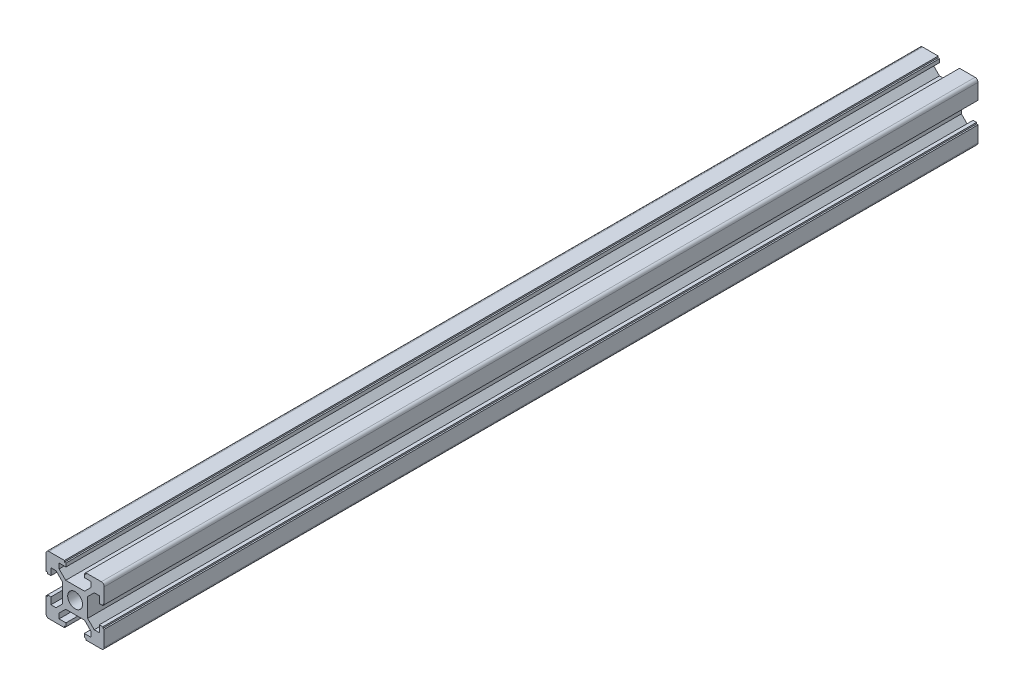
ISO-10303-21;
HEADER;
FILE_DESCRIPTION(('STEP AP214'),'2;1');
FILE_NAME('part.step','',(''),(''),'','','');
FILE_SCHEMA(('AUTOMOTIVE_DESIGN { 1 0 10303 214 1 1 1 1 }'));
ENDSEC;
DATA;
#1=APPLICATION_CONTEXT('core data for automotive mechanical design processes');
#2=APPLICATION_PROTOCOL_DEFINITION('international standard','automotive_design',2000,#1);
#3=PRODUCT_CONTEXT('',#1,'mechanical');
#4=PRODUCT('Part','Part','',(#3));
#5=PRODUCT_RELATED_PRODUCT_CATEGORY('part','',(#4));
#6=PRODUCT_DEFINITION_FORMATION('','',#4);
#7=PRODUCT_DEFINITION_CONTEXT('part definition',#1,'design');
#8=PRODUCT_DEFINITION('design','',#6,#7);
#9=PRODUCT_DEFINITION_SHAPE('','',#8);
#10=(LENGTH_UNIT() NAMED_UNIT(*) SI_UNIT(.MILLI.,.METRE.));
#11=(NAMED_UNIT(*) PLANE_ANGLE_UNIT() SI_UNIT($,.RADIAN.));
#12=(NAMED_UNIT(*) SI_UNIT($,.STERADIAN.) SOLID_ANGLE_UNIT());
#13=UNCERTAINTY_MEASURE_WITH_UNIT(LENGTH_MEASURE(1.E-05),#10,'distance_accuracy_value','');
#14=(GEOMETRIC_REPRESENTATION_CONTEXT(3) GLOBAL_UNCERTAINTY_ASSIGNED_CONTEXT((#13)) GLOBAL_UNIT_ASSIGNED_CONTEXT((#10,
#11,#12)) REPRESENTATION_CONTEXT('',''));
#15=CARTESIAN_POINT('',(0.,0.,0.));
#16=DIRECTION('',(0.,0.,1.));
#17=DIRECTION('',(1.,0.,0.));
#18=AXIS2_PLACEMENT_3D('',#15,#16,#17);
#19=CARTESIAN_POINT('',(-9.00000000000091,-9.00000000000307,150.));
#20=DIRECTION('',(0.,0.,1.));
#21=DIRECTION('',(1.,0.,0.));
#22=AXIS2_PLACEMENT_3D('',#19,#20,#21);
#23=PLANE('',#22);
#24=CARTESIAN_POINT('',(-9.00000000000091,-9.00000000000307,150.));
#25=DIRECTION('',(0.,0.,1.));
#26=DIRECTION('',(1.,0.,0.));
#27=AXIS2_PLACEMENT_3D('',#24,#25,#26);
#28=CIRCLE('',#27,0.999999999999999);
#29=CARTESIAN_POINT('',(-10.0000000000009,-9.00000000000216,150.));
#30=VERTEX_POINT('',#29);
#31=CARTESIAN_POINT('',(-9.00000000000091,-10.0000000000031,150.));
#32=VERTEX_POINT('',#31);
#33=EDGE_CURVE('E599',#30,#32,#28,.T.);
#34=ORIENTED_EDGE('',*,*,#33,.T.);
#35=DIRECTION('',(1.,1.69905626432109E-13,0.));
#36=VECTOR('',#35,1.);
#37=CARTESIAN_POINT('',(-9.00000000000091,-10.0000000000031,150.));
#38=LINE('',#37,#36);
#39=CARTESIAN_POINT('',(-3.65000000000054,-10.0000000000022,150.));
#40=VERTEX_POINT('',#39);
#41=EDGE_CURVE('E263',#32,#40,#38,.T.);
#42=ORIENTED_EDGE('',*,*,#41,.T.);
#43=DIRECTION('',(0.,1.,0.));
#44=VECTOR('',#43,1.);
#45=CARTESIAN_POINT('',(-3.65000000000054,-10.0000000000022,150.));
#46=LINE('',#45,#44);
#47=CARTESIAN_POINT('',(-3.65000000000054,-9.50000000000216,150.));
#48=VERTEX_POINT('',#47);
#49=EDGE_CURVE('E782',#40,#48,#46,.T.);
#50=ORIENTED_EDGE('',*,*,#49,.T.);
#51=DIRECTION('',(1.,-1.8179902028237E-12,0.));
#52=VECTOR('',#51,1.);
#53=CARTESIAN_POINT('',(-3.65000000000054,-9.50000000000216,150.));
#54=LINE('',#53,#52);
#55=CARTESIAN_POINT('',(-3.15000000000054,-9.50000000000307,150.));
#56=VERTEX_POINT('',#55);
#57=EDGE_CURVE('E801',#48,#56,#54,.T.);
#58=ORIENTED_EDGE('',*,*,#57,.T.);
#59=DIRECTION('',(0.,1.,0.));
#60=VECTOR('',#59,1.);
#61=CARTESIAN_POINT('',(-3.15000000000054,-9.50000000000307,150.));
#62=LINE('',#61,#60);
#63=CARTESIAN_POINT('',(-3.15000000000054,-8.30000000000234,150.));
#64=VERTEX_POINT('',#63);
#65=EDGE_CURVE('E798',#56,#64,#62,.T.);
#66=ORIENTED_EDGE('',*,*,#65,.T.);
#67=DIRECTION('',(-1.,0.,0.));
#68=VECTOR('',#67,1.);
#69=CARTESIAN_POINT('',(-3.15000000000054,-8.30000000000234,150.));
#70=LINE('',#69,#68);
#71=CARTESIAN_POINT('',(-5.50000000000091,-8.30000000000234,150.));
#72=VERTEX_POINT('',#71);
#73=EDGE_CURVE('E800',#64,#72,#70,.T.);
#74=ORIENTED_EDGE('',*,*,#73,.T.);
#75=DIRECTION('',(0.,1.,0.));
#76=VECTOR('',#75,1.);
#77=CARTESIAN_POINT('',(-5.50000000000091,-8.30000000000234,150.));
#78=LINE('',#77,#76);
#79=CARTESIAN_POINT('',(-5.50000000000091,-6.56066017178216,150.));
#80=VERTEX_POINT('',#79);
#81=EDGE_CURVE('E803',#72,#80,#78,.T.);
#82=ORIENTED_EDGE('',*,*,#81,.T.);
#83=DIRECTION('',(0.707106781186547,0.707106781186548,0.));
#84=VECTOR('',#83,1.);
#85=CARTESIAN_POINT('',(-5.50000000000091,-6.56066017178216,150.));
#86=LINE('',#85,#84);
#87=CARTESIAN_POINT('',(-3.23933982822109,-4.30000000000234,150.));
#88=VERTEX_POINT('',#87);
#89=EDGE_CURVE('E809',#80,#88,#86,.T.);
#90=ORIENTED_EDGE('',*,*,#89,.T.);
#91=DIRECTION('',(1.,0.,0.));
#92=VECTOR('',#91,1.);
#93=CARTESIAN_POINT('',(-3.23933982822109,-4.30000000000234,150.));
#94=LINE('',#93,#92);
#95=CARTESIAN_POINT('',(3.23933982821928,-4.30000000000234,150.));
#96=VERTEX_POINT('',#95);
#97=EDGE_CURVE('E811',#88,#96,#94,.T.);
#98=ORIENTED_EDGE('',*,*,#97,.T.);
#99=DIRECTION('',(0.707106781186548,-0.707106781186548,0.));
#100=VECTOR('',#99,1.);
#101=CARTESIAN_POINT('',(3.23933982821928,-4.30000000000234,150.));
#102=LINE('',#101,#100);
#103=CARTESIAN_POINT('',(5.49999999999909,-6.56066017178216,150.));
#104=VERTEX_POINT('',#103);
#105=EDGE_CURVE('E813',#96,#104,#102,.T.);
#106=ORIENTED_EDGE('',*,*,#105,.T.);
#107=DIRECTION('',(0.,-1.,0.));
#108=VECTOR('',#107,1.);
#109=CARTESIAN_POINT('',(5.49999999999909,-6.56066017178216,150.));
#110=LINE('',#109,#108);
#111=CARTESIAN_POINT('',(5.49999999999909,-8.30000000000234,150.));
#112=VERTEX_POINT('',#111);
#113=EDGE_CURVE('E815',#104,#112,#110,.T.);
#114=ORIENTED_EDGE('',*,*,#113,.T.);
#115=DIRECTION('',(-1.,0.,0.));
#116=VECTOR('',#115,1.);
#117=CARTESIAN_POINT('',(5.49999999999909,-8.30000000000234,150.));
#118=LINE('',#117,#116);
#119=CARTESIAN_POINT('',(3.14999999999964,-8.30000000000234,150.));
#120=VERTEX_POINT('',#119);
#121=EDGE_CURVE('E817',#112,#120,#118,.T.);
#122=ORIENTED_EDGE('',*,*,#121,.T.);
#123=DIRECTION('',(0.,-1.,0.));
#124=VECTOR('',#123,1.);
#125=CARTESIAN_POINT('',(3.14999999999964,-8.30000000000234,150.));
#126=LINE('',#125,#124);
#127=CARTESIAN_POINT('',(3.14999999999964,-9.50000000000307,150.));
#128=VERTEX_POINT('',#127);
#129=EDGE_CURVE('E819',#120,#128,#126,.T.);
#130=ORIENTED_EDGE('',*,*,#129,.T.);
#131=DIRECTION('',(1.,1.8179902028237E-12,0.));
#132=VECTOR('',#131,1.);
#133=CARTESIAN_POINT('',(3.14999999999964,-9.50000000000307,150.));
#134=LINE('',#133,#132);
#135=CARTESIAN_POINT('',(3.64999999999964,-9.50000000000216,150.));
#136=VERTEX_POINT('',#135);
#137=EDGE_CURVE('E821',#128,#136,#134,.T.);
#138=ORIENTED_EDGE('',*,*,#137,.T.);
#139=DIRECTION('',(0.,-1.,0.));
#140=VECTOR('',#139,1.);
#141=CARTESIAN_POINT('',(3.64999999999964,-9.50000000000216,150.));
#142=LINE('',#141,#140);
#143=CARTESIAN_POINT('',(3.64999999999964,-10.0000000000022,150.));
#144=VERTEX_POINT('',#143);
#145=EDGE_CURVE('E823',#136,#144,#142,.T.);
#146=ORIENTED_EDGE('',*,*,#145,.T.);
#147=DIRECTION('',(1.,-1.70229873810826E-13,0.));
#148=VECTOR('',#147,1.);
#149=CARTESIAN_POINT('',(3.64999999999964,-10.0000000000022,150.));
#150=LINE('',#149,#148);
#151=CARTESIAN_POINT('',(8.99999999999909,-10.0000000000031,150.));
#152=VERTEX_POINT('',#151);
#153=EDGE_CURVE('E825',#144,#152,#150,.T.);
#154=ORIENTED_EDGE('',*,*,#153,.T.);
#155=CARTESIAN_POINT('',(8.99999999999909,-9.00000000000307,150.));
#156=DIRECTION('',(0.,0.,1.));
#157=DIRECTION('',(1.,0.,0.));
#158=AXIS2_PLACEMENT_3D('',#155,#156,#157);
#159=CIRCLE('',#158,1.);
#160=CARTESIAN_POINT('',(9.99999999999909,-9.00000000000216,150.));
#161=VERTEX_POINT('',#160);
#162=EDGE_CURVE('E827',#152,#161,#159,.T.);
#163=ORIENTED_EDGE('',*,*,#162,.T.);
#164=DIRECTION('',(0.,1.,0.));
#165=VECTOR('',#164,1.);
#166=CARTESIAN_POINT('',(9.99999999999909,-9.00000000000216,150.));
#167=LINE('',#166,#165);
#168=CARTESIAN_POINT('',(9.99999999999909,-3.65000000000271,150.));
#169=VERTEX_POINT('',#168);
#170=EDGE_CURVE('E829',#161,#169,#167,.T.);
#171=ORIENTED_EDGE('',*,*,#170,.T.);
#172=DIRECTION('',(-1.,0.,0.));
#173=VECTOR('',#172,1.);
#174=CARTESIAN_POINT('',(9.99999999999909,-3.65000000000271,150.));
#175=LINE('',#174,#173);
#176=CARTESIAN_POINT('',(9.49999999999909,-3.65000000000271,150.));
#177=VERTEX_POINT('',#176);
#178=EDGE_CURVE('E831',#169,#177,#175,.T.);
#179=ORIENTED_EDGE('',*,*,#178,.T.);
#180=DIRECTION('',(0.,1.,0.));
#181=VECTOR('',#180,1.);
#182=CARTESIAN_POINT('',(9.49999999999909,-3.65000000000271,150.));
#183=LINE('',#182,#181);
#184=CARTESIAN_POINT('',(9.49999999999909,-3.15000000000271,150.));
#185=VERTEX_POINT('',#184);
#186=EDGE_CURVE('E833',#177,#185,#183,.T.);
#187=ORIENTED_EDGE('',*,*,#186,.T.);
#188=DIRECTION('',(-1.,0.,0.));
#189=VECTOR('',#188,1.);
#190=CARTESIAN_POINT('',(9.49999999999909,-3.15000000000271,150.));
#191=LINE('',#190,#189);
#192=CARTESIAN_POINT('',(8.29999999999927,-3.15000000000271,150.));
#193=VERTEX_POINT('',#192);
#194=EDGE_CURVE('E835',#185,#193,#191,.T.);
#195=ORIENTED_EDGE('',*,*,#194,.T.);
#196=DIRECTION('',(0.,-1.,0.));
#197=VECTOR('',#196,1.);
#198=CARTESIAN_POINT('',(8.29999999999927,-3.15000000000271,150.));
#199=LINE('',#198,#197);
#200=CARTESIAN_POINT('',(8.29999999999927,-5.50000000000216,150.));
#201=VERTEX_POINT('',#200);
#202=EDGE_CURVE('E837',#193,#201,#199,.T.);
#203=ORIENTED_EDGE('',*,*,#202,.T.);
#204=DIRECTION('',(-1.,-5.23107933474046E-13,0.));
#205=VECTOR('',#204,1.);
#206=CARTESIAN_POINT('',(8.29999999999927,-5.50000000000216,150.));
#207=LINE('',#206,#205);
#208=CARTESIAN_POINT('',(6.56066017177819,-5.50000000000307,150.));
#209=VERTEX_POINT('',#208);
#210=EDGE_CURVE('E839',#201,#209,#207,.T.);
#211=ORIENTED_EDGE('',*,*,#210,.T.);
#212=DIRECTION('',(-0.707106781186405,0.70710678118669,0.));
#213=VECTOR('',#212,1.);
#214=CARTESIAN_POINT('',(6.56066017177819,-5.50000000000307,150.));
#215=LINE('',#214,#213);
#216=CARTESIAN_POINT('',(4.29999999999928,-3.23933982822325,150.));
#217=VERTEX_POINT('',#216);
#218=EDGE_CURVE('E841',#209,#217,#215,.T.);
#219=ORIENTED_EDGE('',*,*,#218,.T.);
#220=DIRECTION('',(0.,1.,0.));
#221=VECTOR('',#220,1.);
#222=CARTESIAN_POINT('',(4.29999999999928,-3.23933982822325,150.));
#223=LINE('',#222,#221);
#224=CARTESIAN_POINT('',(4.29999999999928,3.23933982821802,150.));
#225=VERTEX_POINT('',#224);
#226=EDGE_CURVE('E843',#217,#225,#223,.T.);
#227=ORIENTED_EDGE('',*,*,#226,.T.);
#228=DIRECTION('',(0.707106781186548,0.707106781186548,0.));
#229=VECTOR('',#228,1.);
#230=CARTESIAN_POINT('',(4.29999999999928,3.23933982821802,150.));
#231=LINE('',#230,#229);
#232=CARTESIAN_POINT('',(6.56066017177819,5.49999999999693,150.));
#233=VERTEX_POINT('',#232);
#234=EDGE_CURVE('E845',#225,#233,#231,.T.);
#235=ORIENTED_EDGE('',*,*,#234,.T.);
#236=DIRECTION('',(1.,0.,0.));
#237=VECTOR('',#236,1.);
#238=CARTESIAN_POINT('',(6.56066017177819,5.49999999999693,150.));
#239=LINE('',#238,#237);
#240=CARTESIAN_POINT('',(8.29999999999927,5.49999999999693,150.));
#241=VERTEX_POINT('',#240);
#242=EDGE_CURVE('E847',#233,#241,#239,.T.);
#243=ORIENTED_EDGE('',*,*,#242,.T.);
#244=DIRECTION('',(0.,-1.,0.));
#245=VECTOR('',#244,1.);
#246=CARTESIAN_POINT('',(8.29999999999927,5.49999999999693,150.));
#247=LINE('',#246,#245);
#248=CARTESIAN_POINT('',(8.29999999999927,3.14999999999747,150.));
#249=VERTEX_POINT('',#248);
#250=EDGE_CURVE('E849',#241,#249,#247,.T.);
#251=ORIENTED_EDGE('',*,*,#250,.T.);
#252=DIRECTION('',(1.,0.,0.));
#253=VECTOR('',#252,1.);
#254=CARTESIAN_POINT('',(8.29999999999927,3.14999999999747,150.));
#255=LINE('',#254,#253);
#256=CARTESIAN_POINT('',(9.49999999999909,3.14999999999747,150.));
#257=VERTEX_POINT('',#256);
#258=EDGE_CURVE('E851',#249,#257,#255,.T.);
#259=ORIENTED_EDGE('',*,*,#258,.T.);
#260=DIRECTION('',(0.,1.,0.));
#261=VECTOR('',#260,1.);
#262=CARTESIAN_POINT('',(9.49999999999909,3.14999999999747,150.));
#263=LINE('',#262,#261);
#264=CARTESIAN_POINT('',(9.49999999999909,3.64999999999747,150.));
#265=VERTEX_POINT('',#264);
#266=EDGE_CURVE('E853',#257,#265,#263,.T.);
#267=ORIENTED_EDGE('',*,*,#266,.T.);
#268=DIRECTION('',(1.,0.,0.));
#269=VECTOR('',#268,1.);
#270=CARTESIAN_POINT('',(9.49999999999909,3.64999999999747,150.));
#271=LINE('',#270,#269);
#272=CARTESIAN_POINT('',(9.99999999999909,3.64999999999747,150.));
#273=VERTEX_POINT('',#272);
#274=EDGE_CURVE('E855',#265,#273,#271,.T.);
#275=ORIENTED_EDGE('',*,*,#274,.T.);
#276=DIRECTION('',(0.,1.,0.));
#277=VECTOR('',#276,1.);
#278=CARTESIAN_POINT('',(9.99999999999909,3.64999999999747,150.));
#279=LINE('',#278,#277);
#280=CARTESIAN_POINT('',(9.99999999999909,8.99999999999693,150.));
#281=VERTEX_POINT('',#280);
#282=EDGE_CURVE('E857',#273,#281,#279,.T.);
#283=ORIENTED_EDGE('',*,*,#282,.T.);
#284=CARTESIAN_POINT('',(8.99999999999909,8.99999999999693,150.));
#285=DIRECTION('',(0.,0.,1.));
#286=DIRECTION('',(1.,0.,0.));
#287=AXIS2_PLACEMENT_3D('',#284,#285,#286);
#288=CIRCLE('',#287,1.);
#289=CARTESIAN_POINT('',(8.99999999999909,9.99999999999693,150.));
#290=VERTEX_POINT('',#289);
#291=EDGE_CURVE('E859',#281,#290,#288,.T.);
#292=ORIENTED_EDGE('',*,*,#291,.T.);
#293=DIRECTION('',(-1.,0.,0.));
#294=VECTOR('',#293,1.);
#295=CARTESIAN_POINT('',(8.99999999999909,9.99999999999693,150.));
#296=LINE('',#295,#294);
#297=CARTESIAN_POINT('',(3.64999999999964,9.99999999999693,150.));
#298=VERTEX_POINT('',#297);
#299=EDGE_CURVE('E861',#290,#298,#296,.T.);
#300=ORIENTED_EDGE('',*,*,#299,.T.);
#301=DIRECTION('',(0.,-1.,0.));
#302=VECTOR('',#301,1.);
#303=CARTESIAN_POINT('',(3.64999999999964,9.99999999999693,150.));
#304=LINE('',#303,#302);
#305=CARTESIAN_POINT('',(3.64999999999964,9.49999999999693,150.));
#306=VERTEX_POINT('',#305);
#307=EDGE_CURVE('E863',#298,#306,#304,.T.);
#308=ORIENTED_EDGE('',*,*,#307,.T.);
#309=DIRECTION('',(-1.,0.,0.));
#310=VECTOR('',#309,1.);
#311=CARTESIAN_POINT('',(3.64999999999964,9.49999999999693,150.));
#312=LINE('',#311,#310);
#313=CARTESIAN_POINT('',(3.14999999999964,9.49999999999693,150.));
#314=VERTEX_POINT('',#313);
#315=EDGE_CURVE('E865',#306,#314,#312,.T.);
#316=ORIENTED_EDGE('',*,*,#315,.T.);
#317=DIRECTION('',(0.,-1.,0.));
#318=VECTOR('',#317,1.);
#319=CARTESIAN_POINT('',(3.14999999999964,9.49999999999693,150.));
#320=LINE('',#319,#318);
#321=CARTESIAN_POINT('',(3.14999999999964,8.29999999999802,150.));
#322=VERTEX_POINT('',#321);
#323=EDGE_CURVE('E867',#314,#322,#320,.T.);
#324=ORIENTED_EDGE('',*,*,#323,.T.);
#325=DIRECTION('',(1.,-3.86806426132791E-13,0.));
#326=VECTOR('',#325,1.);
#327=CARTESIAN_POINT('',(3.14999999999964,8.29999999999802,150.));
#328=LINE('',#327,#326);
#329=CARTESIAN_POINT('',(5.49999999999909,8.29999999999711,150.));
#330=VERTEX_POINT('',#329);
#331=EDGE_CURVE('E869',#322,#330,#328,.T.);
#332=ORIENTED_EDGE('',*,*,#331,.T.);
#333=DIRECTION('',(0.,-1.,0.));
#334=VECTOR('',#333,1.);
#335=CARTESIAN_POINT('',(5.49999999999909,8.29999999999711,150.));
#336=LINE('',#335,#334);
#337=CARTESIAN_POINT('',(5.49999999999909,6.56066017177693,150.));
#338=VERTEX_POINT('',#337);
#339=EDGE_CURVE('E871',#330,#338,#336,.T.);
#340=ORIENTED_EDGE('',*,*,#339,.T.);
#341=DIRECTION('',(-0.707106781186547,-0.707106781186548,0.));
#342=VECTOR('',#341,1.);
#343=CARTESIAN_POINT('',(5.49999999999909,6.56066017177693,150.));
#344=LINE('',#343,#342);
#345=CARTESIAN_POINT('',(3.23933982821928,4.29999999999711,150.));
#346=VERTEX_POINT('',#345);
#347=EDGE_CURVE('E873',#338,#346,#344,.T.);
#348=ORIENTED_EDGE('',*,*,#347,.T.);
#349=DIRECTION('',(-1.,2.81146737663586E-13,0.));
#350=VECTOR('',#349,1.);
#351=CARTESIAN_POINT('',(3.23933982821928,4.29999999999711,150.));
#352=LINE('',#351,#350);
#353=CARTESIAN_POINT('',(-3.23933982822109,4.29999999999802,150.));
#354=VERTEX_POINT('',#353);
#355=EDGE_CURVE('E875',#346,#354,#352,.T.);
#356=ORIENTED_EDGE('',*,*,#355,.T.);
#357=DIRECTION('',(-0.70710678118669,0.707106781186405,0.));
#358=VECTOR('',#357,1.);
#359=CARTESIAN_POINT('',(-3.23933982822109,4.29999999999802,150.));
#360=LINE('',#359,#358);
#361=CARTESIAN_POINT('',(-5.50000000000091,6.56066017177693,150.));
#362=VERTEX_POINT('',#361);
#363=EDGE_CURVE('E877',#354,#362,#360,.T.);
#364=ORIENTED_EDGE('',*,*,#363,.T.);
#365=DIRECTION('',(0.,1.,0.));
#366=VECTOR('',#365,1.);
#367=CARTESIAN_POINT('',(-5.50000000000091,6.56066017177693,150.));
#368=LINE('',#367,#366);
#369=CARTESIAN_POINT('',(-5.50000000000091,8.29999999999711,150.));
#370=VERTEX_POINT('',#369);
#371=EDGE_CURVE('E879',#362,#370,#368,.T.);
#372=ORIENTED_EDGE('',*,*,#371,.T.);
#373=DIRECTION('',(1.,3.86806426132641E-13,0.));
#374=VECTOR('',#373,1.);
#375=CARTESIAN_POINT('',(-5.50000000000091,8.29999999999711,150.));
#376=LINE('',#375,#374);
#377=CARTESIAN_POINT('',(-3.15000000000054,8.29999999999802,150.));
#378=VERTEX_POINT('',#377);
#379=EDGE_CURVE('E881',#370,#378,#376,.T.);
#380=ORIENTED_EDGE('',*,*,#379,.T.);
#381=DIRECTION('',(0.,1.,0.));
#382=VECTOR('',#381,1.);
#383=CARTESIAN_POINT('',(-3.15000000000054,8.29999999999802,150.));
#384=LINE('',#383,#382);
#385=CARTESIAN_POINT('',(-3.15000000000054,9.49999999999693,150.));
#386=VERTEX_POINT('',#385);
#387=EDGE_CURVE('E883',#378,#386,#384,.T.);
#388=ORIENTED_EDGE('',*,*,#387,.T.);
#389=DIRECTION('',(-1.,0.,0.));
#390=VECTOR('',#389,1.);
#391=CARTESIAN_POINT('',(-3.15000000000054,9.49999999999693,150.));
#392=LINE('',#391,#390);
#393=CARTESIAN_POINT('',(-3.65000000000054,9.49999999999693,150.));
#394=VERTEX_POINT('',#393);
#395=EDGE_CURVE('E885',#386,#394,#392,.T.);
#396=ORIENTED_EDGE('',*,*,#395,.T.);
#397=DIRECTION('',(0.,1.,0.));
#398=VECTOR('',#397,1.);
#399=CARTESIAN_POINT('',(-3.65000000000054,9.49999999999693,150.));
#400=LINE('',#399,#398);
#401=CARTESIAN_POINT('',(-3.65000000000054,9.99999999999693,150.));
#402=VERTEX_POINT('',#401);
#403=EDGE_CURVE('E887',#394,#402,#400,.T.);
#404=ORIENTED_EDGE('',*,*,#403,.T.);
#405=DIRECTION('',(-1.,0.,0.));
#406=VECTOR('',#405,1.);
#407=CARTESIAN_POINT('',(-3.65000000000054,9.99999999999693,150.));
#408=LINE('',#407,#406);
#409=CARTESIAN_POINT('',(-9.00000000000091,9.99999999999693,150.));
#410=VERTEX_POINT('',#409);
#411=EDGE_CURVE('E889',#402,#410,#408,.T.);
#412=ORIENTED_EDGE('',*,*,#411,.T.);
#413=CARTESIAN_POINT('',(-9.00000000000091,8.99999999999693,150.));
#414=DIRECTION('',(0.,0.,1.));
#415=DIRECTION('',(1.,0.,0.));
#416=AXIS2_PLACEMENT_3D('',#413,#414,#415);
#417=CIRCLE('',#416,1.);
#418=CARTESIAN_POINT('',(-10.0000000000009,8.99999999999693,150.));
#419=VERTEX_POINT('',#418);
#420=EDGE_CURVE('E891',#410,#419,#417,.T.);
#421=ORIENTED_EDGE('',*,*,#420,.T.);
#422=DIRECTION('',(0.,-1.,0.));
#423=VECTOR('',#422,1.);
#424=CARTESIAN_POINT('',(-10.0000000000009,8.99999999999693,150.));
#425=LINE('',#424,#423);
#426=CARTESIAN_POINT('',(-10.0000000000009,3.64999999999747,150.));
#427=VERTEX_POINT('',#426);
#428=EDGE_CURVE('E893',#419,#427,#425,.T.);
#429=ORIENTED_EDGE('',*,*,#428,.T.);
#430=DIRECTION('',(1.,0.,0.));
#431=VECTOR('',#430,1.);
#432=CARTESIAN_POINT('',(-10.0000000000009,3.64999999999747,150.));
#433=LINE('',#432,#431);
#434=CARTESIAN_POINT('',(-9.50000000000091,3.64999999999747,150.));
#435=VERTEX_POINT('',#434);
#436=EDGE_CURVE('E895',#427,#435,#433,.T.);
#437=ORIENTED_EDGE('',*,*,#436,.T.);
#438=DIRECTION('',(0.,-1.,0.));
#439=VECTOR('',#438,1.);
#440=CARTESIAN_POINT('',(-9.50000000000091,3.64999999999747,150.));
#441=LINE('',#440,#439);
#442=CARTESIAN_POINT('',(-9.50000000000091,3.14999999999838,150.));
#443=VERTEX_POINT('',#442);
#444=EDGE_CURVE('E897',#435,#443,#441,.T.);
#445=ORIENTED_EDGE('',*,*,#444,.T.);
#446=DIRECTION('',(1.,-7.57495917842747E-13,0.));
#447=VECTOR('',#446,1.);
#448=CARTESIAN_POINT('',(-9.50000000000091,3.14999999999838,150.));
#449=LINE('',#448,#447);
#450=CARTESIAN_POINT('',(-8.30000000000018,3.14999999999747,150.));
#451=VERTEX_POINT('',#450);
#452=EDGE_CURVE('E899',#443,#451,#449,.T.);
#453=ORIENTED_EDGE('',*,*,#452,.T.);
#454=DIRECTION('',(0.,1.,0.));
#455=VECTOR('',#454,1.);
#456=CARTESIAN_POINT('',(-8.30000000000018,3.14999999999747,150.));
#457=LINE('',#456,#455);
#458=CARTESIAN_POINT('',(-8.30000000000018,5.49999999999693,150.));
#459=VERTEX_POINT('',#458);
#460=EDGE_CURVE('E901',#451,#459,#457,.T.);
#461=ORIENTED_EDGE('',*,*,#460,.T.);
#462=DIRECTION('',(1.,0.,0.));
#463=VECTOR('',#462,1.);
#464=CARTESIAN_POINT('',(-8.30000000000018,5.49999999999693,150.));
#465=LINE('',#464,#463);
#466=CARTESIAN_POINT('',(-6.56066017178,5.49999999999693,150.));
#467=VERTEX_POINT('',#466);
#468=EDGE_CURVE('E903',#459,#467,#465,.T.);
#469=ORIENTED_EDGE('',*,*,#468,.T.);
#470=DIRECTION('',(0.70710678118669,-0.707106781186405,0.));
#471=VECTOR('',#470,1.);
#472=CARTESIAN_POINT('',(-6.56066017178,5.49999999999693,150.));
#473=LINE('',#472,#471);
#474=CARTESIAN_POINT('',(-4.30000000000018,3.23933982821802,150.));
#475=VERTEX_POINT('',#474);
#476=EDGE_CURVE('E905',#467,#475,#473,.T.);
#477=ORIENTED_EDGE('',*,*,#476,.T.);
#478=DIRECTION('',(0.,-1.,0.));
#479=VECTOR('',#478,1.);
#480=CARTESIAN_POINT('',(-4.30000000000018,3.23933982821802,150.));
#481=LINE('',#480,#479);
#482=CARTESIAN_POINT('',(-4.30000000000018,-3.23933982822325,150.));
#483=VERTEX_POINT('',#482);
#484=EDGE_CURVE('E907',#475,#483,#481,.T.);
#485=ORIENTED_EDGE('',*,*,#484,.T.);
#486=DIRECTION('',(-0.707106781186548,-0.707106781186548,0.));
#487=VECTOR('',#486,1.);
#488=CARTESIAN_POINT('',(-4.30000000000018,-3.23933982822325,150.));
#489=LINE('',#488,#487);
#490=CARTESIAN_POINT('',(-6.56066017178,-5.50000000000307,150.));
#491=VERTEX_POINT('',#490);
#492=EDGE_CURVE('E909',#483,#491,#489,.T.);
#493=ORIENTED_EDGE('',*,*,#492,.T.);
#494=DIRECTION('',(-1.,5.23107933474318E-13,0.));
#495=VECTOR('',#494,1.);
#496=CARTESIAN_POINT('',(-6.56066017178,-5.50000000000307,150.));
#497=LINE('',#496,#495);
#498=CARTESIAN_POINT('',(-8.30000000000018,-5.50000000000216,150.));
#499=VERTEX_POINT('',#498);
#500=EDGE_CURVE('E911',#491,#499,#497,.T.);
#501=ORIENTED_EDGE('',*,*,#500,.T.);
#502=DIRECTION('',(0.,1.,0.));
#503=VECTOR('',#502,1.);
#504=CARTESIAN_POINT('',(-8.30000000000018,-5.50000000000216,150.));
#505=LINE('',#504,#503);
#506=CARTESIAN_POINT('',(-8.30000000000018,-3.15000000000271,150.));
#507=VERTEX_POINT('',#506);
#508=EDGE_CURVE('E913',#499,#507,#505,.T.);
#509=ORIENTED_EDGE('',*,*,#508,.T.);
#510=DIRECTION('',(-1.,0.,0.));
#511=VECTOR('',#510,1.);
#512=CARTESIAN_POINT('',(-8.30000000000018,-3.15000000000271,150.));
#513=LINE('',#512,#511);
#514=CARTESIAN_POINT('',(-9.50000000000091,-3.15000000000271,150.));
#515=VERTEX_POINT('',#514);
#516=EDGE_CURVE('E450',#507,#515,#513,.T.);
#517=ORIENTED_EDGE('',*,*,#516,.T.);
#518=DIRECTION('',(0.,-1.,0.));
#519=VECTOR('',#518,1.);
#520=CARTESIAN_POINT('',(-9.50000000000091,-3.15000000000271,150.));
#521=LINE('',#520,#519);
#522=CARTESIAN_POINT('',(-9.50000000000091,-3.65000000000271,150.));
#523=VERTEX_POINT('',#522);
#524=EDGE_CURVE('E444',#515,#523,#521,.T.);
#525=ORIENTED_EDGE('',*,*,#524,.T.);
#526=DIRECTION('',(-1.,0.,0.));
#527=VECTOR('',#526,1.);
#528=CARTESIAN_POINT('',(-9.50000000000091,-3.65000000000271,150.));
#529=LINE('',#528,#527);
#530=CARTESIAN_POINT('',(-10.0000000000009,-3.65000000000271,150.));
#531=VERTEX_POINT('',#530);
#532=EDGE_CURVE('E448',#523,#531,#529,.T.);
#533=ORIENTED_EDGE('',*,*,#532,.T.);
#534=DIRECTION('',(0.,-1.,0.));
#535=VECTOR('',#534,1.);
#536=CARTESIAN_POINT('',(-10.0000000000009,-3.65000000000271,150.));
#537=LINE('',#536,#535);
#538=EDGE_CURVE('E52',#531,#30,#537,.T.);
#539=ORIENTED_EDGE('',*,*,#538,.T.);
#540=EDGE_LOOP('',(#34,#42,#50,#58,#66,#74,#82,#90,#98,#106,#114,#122,#130,#138,#146,#154,#163,
#171,#179,#187,#195,#203,#211,#219,#227,#235,#243,#251,#259,#267,#275,#283,#292,#300,#308,#316,
#324,#332,#340,#348,#356,#364,#372,#380,#388,#396,#404,#412,#421,#429,#437,#445,#453,#461,#469,
#477,#485,#493,#501,#509,#517,#525,#533,#539));
#541=FACE_BOUND('',#540,.T.);
#542=CARTESIAN_POINT('',(0.,0.,150.));
#543=DIRECTION('',(0.,0.,1.));
#544=DIRECTION('',(1.,0.,0.));
#545=AXIS2_PLACEMENT_3D('',#542,#543,#544);
#546=CIRCLE('',#545,2.55000000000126);
#547=CARTESIAN_POINT('',(2.55000000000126,0.,150.));
#548=VERTEX_POINT('',#547);
#549=EDGE_CURVE('E472',#548,#548,#546,.T.);
#550=ORIENTED_EDGE('',*,*,#549,.F.);
#551=EDGE_LOOP('',(#550));
#552=FACE_BOUND('',#551,.T.);
#553=ADVANCED_FACE('F35',(#541,#552),#23,.T.);
#554=CARTESIAN_POINT('',(-9.00000000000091,-9.00000000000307,-150.));
#555=DIRECTION('',(0.,0.,1.));
#556=DIRECTION('',(1.,0.,0.));
#557=AXIS2_PLACEMENT_3D('',#554,#555,#556);
#558=PLANE('',#557);
#559=CARTESIAN_POINT('',(-9.00000000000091,-9.00000000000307,-150.));
#560=DIRECTION('',(0.,0.,1.));
#561=DIRECTION('',(1.,0.,0.));
#562=AXIS2_PLACEMENT_3D('',#559,#560,#561);
#563=CIRCLE('',#562,0.999999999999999);
#564=CARTESIAN_POINT('',(-10.0000000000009,-9.00000000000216,-150.));
#565=VERTEX_POINT('',#564);
#566=CARTESIAN_POINT('',(-9.00000000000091,-10.0000000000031,-150.));
#567=VERTEX_POINT('',#566);
#568=EDGE_CURVE('E468',#565,#567,#563,.T.);
#569=ORIENTED_EDGE('',*,*,#568,.F.);
#570=DIRECTION('',(0.,-1.,0.));
#571=VECTOR('',#570,1.);
#572=CARTESIAN_POINT('',(-10.0000000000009,-3.65000000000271,-150.));
#573=LINE('',#572,#571);
#574=CARTESIAN_POINT('',(-10.0000000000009,-3.65000000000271,-150.));
#575=VERTEX_POINT('',#574);
#576=EDGE_CURVE('E255',#575,#565,#573,.T.);
#577=ORIENTED_EDGE('',*,*,#576,.F.);
#578=DIRECTION('',(-1.,0.,0.));
#579=VECTOR('',#578,1.);
#580=CARTESIAN_POINT('',(-9.50000000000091,-3.65000000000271,-150.));
#581=LINE('',#580,#579);
#582=CARTESIAN_POINT('',(-9.50000000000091,-3.65000000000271,-150.));
#583=VERTEX_POINT('',#582);
#584=EDGE_CURVE('E249',#583,#575,#581,.T.);
#585=ORIENTED_EDGE('',*,*,#584,.F.);
#586=DIRECTION('',(0.,-1.,0.));
#587=VECTOR('',#586,1.);
#588=CARTESIAN_POINT('',(-9.50000000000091,-3.15000000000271,-150.));
#589=LINE('',#588,#587);
#590=CARTESIAN_POINT('',(-9.50000000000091,-3.15000000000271,-150.));
#591=VERTEX_POINT('',#590);
#592=EDGE_CURVE('E458',#591,#583,#589,.T.);
#593=ORIENTED_EDGE('',*,*,#592,.F.);
#594=DIRECTION('',(-1.,0.,0.));
#595=VECTOR('',#594,1.);
#596=CARTESIAN_POINT('',(-8.30000000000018,-3.15000000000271,-150.));
#597=LINE('',#596,#595);
#598=CARTESIAN_POINT('',(-8.30000000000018,-3.15000000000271,-150.));
#599=VERTEX_POINT('',#598);
#600=EDGE_CURVE('E594',#599,#591,#597,.T.);
#601=ORIENTED_EDGE('',*,*,#600,.F.);
#602=DIRECTION('',(0.,1.,0.));
#603=VECTOR('',#602,1.);
#604=CARTESIAN_POINT('',(-8.30000000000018,-5.50000000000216,-150.));
#605=LINE('',#604,#603);
#606=CARTESIAN_POINT('',(-8.30000000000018,-5.50000000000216,-150.));
#607=VERTEX_POINT('',#606);
#608=EDGE_CURVE('E592',#607,#599,#605,.T.);
#609=ORIENTED_EDGE('',*,*,#608,.F.);
#610=DIRECTION('',(-1.,5.23107933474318E-13,0.));
#611=VECTOR('',#610,1.);
#612=CARTESIAN_POINT('',(-6.56066017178,-5.50000000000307,-150.));
#613=LINE('',#612,#611);
#614=CARTESIAN_POINT('',(-6.56066017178,-5.50000000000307,-150.));
#615=VERTEX_POINT('',#614);
#616=EDGE_CURVE('E590',#615,#607,#613,.T.);
#617=ORIENTED_EDGE('',*,*,#616,.F.);
#618=DIRECTION('',(-0.707106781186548,-0.707106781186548,0.));
#619=VECTOR('',#618,1.);
#620=CARTESIAN_POINT('',(-4.30000000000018,-3.23933982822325,-150.));
#621=LINE('',#620,#619);
#622=CARTESIAN_POINT('',(-4.30000000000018,-3.23933982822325,-150.));
#623=VERTEX_POINT('',#622);
#624=EDGE_CURVE('E588',#623,#615,#621,.T.);
#625=ORIENTED_EDGE('',*,*,#624,.F.);
#626=DIRECTION('',(0.,-1.,0.));
#627=VECTOR('',#626,1.);
#628=CARTESIAN_POINT('',(-4.30000000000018,-3.07219527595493E-12,-150.));
#629=LINE('',#628,#627);
#630=CARTESIAN_POINT('',(-4.30000000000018,3.23933982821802,-150.));
#631=VERTEX_POINT('',#630);
#632=EDGE_CURVE('E586',#631,#623,#629,.T.);
#633=ORIENTED_EDGE('',*,*,#632,.F.);
#634=DIRECTION('',(0.70710678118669,-0.707106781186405,0.));
#635=VECTOR('',#634,1.);
#636=CARTESIAN_POINT('',(-6.56066017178,5.49999999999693,-150.));
#637=LINE('',#636,#635);
#638=CARTESIAN_POINT('',(-6.56066017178,5.49999999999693,-150.));
#639=VERTEX_POINT('',#638);
#640=EDGE_CURVE('E583',#639,#631,#637,.T.);
#641=ORIENTED_EDGE('',*,*,#640,.F.);
#642=DIRECTION('',(1.,0.,0.));
#643=VECTOR('',#642,1.);
#644=CARTESIAN_POINT('',(-8.30000000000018,5.49999999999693,-150.));
#645=LINE('',#644,#643);
#646=CARTESIAN_POINT('',(-8.30000000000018,5.49999999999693,-150.));
#647=VERTEX_POINT('',#646);
#648=EDGE_CURVE('E581',#647,#639,#645,.T.);
#649=ORIENTED_EDGE('',*,*,#648,.F.);
#650=DIRECTION('',(0.,1.,0.));
#651=VECTOR('',#650,1.);
#652=CARTESIAN_POINT('',(-8.30000000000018,3.14999999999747,-150.));
#653=LINE('',#652,#651);
#654=CARTESIAN_POINT('',(-8.30000000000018,3.14999999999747,-150.));
#655=VERTEX_POINT('',#654);
#656=EDGE_CURVE('E579',#655,#647,#653,.T.);
#657=ORIENTED_EDGE('',*,*,#656,.F.);
#658=DIRECTION('',(1.,-7.57495917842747E-13,0.));
#659=VECTOR('',#658,1.);
#660=CARTESIAN_POINT('',(-9.50000000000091,3.14999999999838,-150.));
#661=LINE('',#660,#659);
#662=CARTESIAN_POINT('',(-9.50000000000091,3.14999999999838,-150.));
#663=VERTEX_POINT('',#662);
#664=EDGE_CURVE('E577',#663,#655,#661,.T.);
#665=ORIENTED_EDGE('',*,*,#664,.F.);
#666=DIRECTION('',(0.,-1.,0.));
#667=VECTOR('',#666,1.);
#668=CARTESIAN_POINT('',(-9.50000000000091,3.64999999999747,-150.));
#669=LINE('',#668,#667);
#670=CARTESIAN_POINT('',(-9.50000000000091,3.64999999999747,-150.));
#671=VERTEX_POINT('',#670);
#672=EDGE_CURVE('E575',#671,#663,#669,.T.);
#673=ORIENTED_EDGE('',*,*,#672,.F.);
#674=DIRECTION('',(1.,0.,0.));
#675=VECTOR('',#674,1.);
#676=CARTESIAN_POINT('',(-10.0000000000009,3.64999999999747,-150.));
#677=LINE('',#676,#675);
#678=CARTESIAN_POINT('',(-10.0000000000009,3.64999999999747,-150.));
#679=VERTEX_POINT('',#678);
#680=EDGE_CURVE('E573',#679,#671,#677,.T.);
#681=ORIENTED_EDGE('',*,*,#680,.F.);
#682=DIRECTION('',(0.,-1.,0.));
#683=VECTOR('',#682,1.);
#684=CARTESIAN_POINT('',(-10.0000000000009,8.99999999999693,-150.));
#685=LINE('',#684,#683);
#686=CARTESIAN_POINT('',(-10.0000000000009,8.99999999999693,-150.));
#687=VERTEX_POINT('',#686);
#688=EDGE_CURVE('E571',#687,#679,#685,.T.);
#689=ORIENTED_EDGE('',*,*,#688,.F.);
#690=CARTESIAN_POINT('',(-9.00000000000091,8.99999999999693,-150.));
#691=DIRECTION('',(0.,0.,1.));
#692=DIRECTION('',(1.,0.,0.));
#693=AXIS2_PLACEMENT_3D('',#690,#691,#692);
#694=CIRCLE('',#693,1.);
#695=CARTESIAN_POINT('',(-9.00000000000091,9.99999999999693,-150.));
#696=VERTEX_POINT('',#695);
#697=EDGE_CURVE('E569',#696,#687,#694,.T.);
#698=ORIENTED_EDGE('',*,*,#697,.F.);
#699=DIRECTION('',(-1.,0.,0.));
#700=VECTOR('',#699,1.);
#701=CARTESIAN_POINT('',(-3.65000000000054,9.99999999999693,-150.));
#702=LINE('',#701,#700);
#703=CARTESIAN_POINT('',(-3.65000000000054,9.99999999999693,-150.));
#704=VERTEX_POINT('',#703);
#705=EDGE_CURVE('E567',#704,#696,#702,.T.);
#706=ORIENTED_EDGE('',*,*,#705,.F.);
#707=DIRECTION('',(0.,1.,0.));
#708=VECTOR('',#707,1.);
#709=CARTESIAN_POINT('',(-3.65000000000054,9.49999999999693,-150.));
#710=LINE('',#709,#708);
#711=CARTESIAN_POINT('',(-3.65000000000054,9.49999999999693,-150.));
#712=VERTEX_POINT('',#711);
#713=EDGE_CURVE('E565',#712,#704,#710,.T.);
#714=ORIENTED_EDGE('',*,*,#713,.F.);
#715=DIRECTION('',(-1.,0.,0.));
#716=VECTOR('',#715,1.);
#717=CARTESIAN_POINT('',(-3.15000000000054,9.49999999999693,-150.));
#718=LINE('',#717,#716);
#719=CARTESIAN_POINT('',(-3.15000000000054,9.49999999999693,-150.));
#720=VERTEX_POINT('',#719);
#721=EDGE_CURVE('E563',#720,#712,#718,.T.);
#722=ORIENTED_EDGE('',*,*,#721,.F.);
#723=DIRECTION('',(0.,1.,0.));
#724=VECTOR('',#723,1.);
#725=CARTESIAN_POINT('',(-3.15000000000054,8.29999999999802,-150.));
#726=LINE('',#725,#724);
#727=CARTESIAN_POINT('',(-3.15000000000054,8.29999999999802,-150.));
#728=VERTEX_POINT('',#727);
#729=EDGE_CURVE('E561',#728,#720,#726,.T.);
#730=ORIENTED_EDGE('',*,*,#729,.F.);
#731=DIRECTION('',(1.,3.86806426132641E-13,0.));
#732=VECTOR('',#731,1.);
#733=CARTESIAN_POINT('',(-5.50000000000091,8.29999999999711,-150.));
#734=LINE('',#733,#732);
#735=CARTESIAN_POINT('',(-5.50000000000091,8.29999999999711,-150.));
#736=VERTEX_POINT('',#735);
#737=EDGE_CURVE('E559',#736,#728,#734,.T.);
#738=ORIENTED_EDGE('',*,*,#737,.F.);
#739=DIRECTION('',(0.,1.,0.));
#740=VECTOR('',#739,1.);
#741=CARTESIAN_POINT('',(-5.50000000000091,6.56066017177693,-150.));
#742=LINE('',#741,#740);
#743=CARTESIAN_POINT('',(-5.50000000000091,6.56066017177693,-150.));
#744=VERTEX_POINT('',#743);
#745=EDGE_CURVE('E557',#744,#736,#742,.T.);
#746=ORIENTED_EDGE('',*,*,#745,.F.);
#747=DIRECTION('',(-0.70710678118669,0.707106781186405,0.));
#748=VECTOR('',#747,1.);
#749=CARTESIAN_POINT('',(-3.23933982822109,4.29999999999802,-150.));
#750=LINE('',#749,#748);
#751=CARTESIAN_POINT('',(-3.23933982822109,4.29999999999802,-150.));
#752=VERTEX_POINT('',#751);
#753=EDGE_CURVE('E555',#752,#744,#750,.T.);
#754=ORIENTED_EDGE('',*,*,#753,.F.);
#755=DIRECTION('',(-1.,0.,0.));
#756=VECTOR('',#755,1.);
#757=CARTESIAN_POINT('',(-9.05525654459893E-13,4.29999999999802,-150.));
#758=LINE('',#757,#756);
#759=CARTESIAN_POINT('',(3.23933982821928,4.29999999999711,-150.));
#760=VERTEX_POINT('',#759);
#761=EDGE_CURVE('E553',#760,#752,#758,.T.);
#762=ORIENTED_EDGE('',*,*,#761,.F.);
#763=DIRECTION('',(-0.707106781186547,-0.707106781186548,0.));
#764=VECTOR('',#763,1.);
#765=CARTESIAN_POINT('',(5.49999999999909,6.56066017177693,-150.));
#766=LINE('',#765,#764);
#767=CARTESIAN_POINT('',(5.49999999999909,6.56066017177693,-150.));
#768=VERTEX_POINT('',#767);
#769=EDGE_CURVE('E550',#768,#760,#766,.T.);
#770=ORIENTED_EDGE('',*,*,#769,.F.);
#771=DIRECTION('',(0.,-1.,0.));
#772=VECTOR('',#771,1.);
#773=CARTESIAN_POINT('',(5.49999999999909,8.29999999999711,-150.));
#774=LINE('',#773,#772);
#775=CARTESIAN_POINT('',(5.49999999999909,8.29999999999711,-150.));
#776=VERTEX_POINT('',#775);
#777=EDGE_CURVE('E548',#776,#768,#774,.T.);
#778=ORIENTED_EDGE('',*,*,#777,.F.);
#779=DIRECTION('',(1.,-3.86806426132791E-13,0.));
#780=VECTOR('',#779,1.);
#781=CARTESIAN_POINT('',(3.14999999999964,8.29999999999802,-150.));
#782=LINE('',#781,#780);
#783=CARTESIAN_POINT('',(3.14999999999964,8.29999999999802,-150.));
#784=VERTEX_POINT('',#783);
#785=EDGE_CURVE('E546',#784,#776,#782,.T.);
#786=ORIENTED_EDGE('',*,*,#785,.F.);
#787=DIRECTION('',(0.,-1.,0.));
#788=VECTOR('',#787,1.);
#789=CARTESIAN_POINT('',(3.14999999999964,9.49999999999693,-150.));
#790=LINE('',#789,#788);
#791=CARTESIAN_POINT('',(3.14999999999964,9.49999999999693,-150.));
#792=VERTEX_POINT('',#791);
#793=EDGE_CURVE('E544',#792,#784,#790,.T.);
#794=ORIENTED_EDGE('',*,*,#793,.F.);
#795=DIRECTION('',(-1.,0.,0.));
#796=VECTOR('',#795,1.);
#797=CARTESIAN_POINT('',(3.64999999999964,9.49999999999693,-150.));
#798=LINE('',#797,#796);
#799=CARTESIAN_POINT('',(3.64999999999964,9.49999999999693,-150.));
#800=VERTEX_POINT('',#799);
#801=EDGE_CURVE('E542',#800,#792,#798,.T.);
#802=ORIENTED_EDGE('',*,*,#801,.F.);
#803=DIRECTION('',(0.,-1.,0.));
#804=VECTOR('',#803,1.);
#805=CARTESIAN_POINT('',(3.64999999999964,9.99999999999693,-150.));
#806=LINE('',#805,#804);
#807=CARTESIAN_POINT('',(3.64999999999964,9.99999999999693,-150.));
#808=VERTEX_POINT('',#807);
#809=EDGE_CURVE('E540',#808,#800,#806,.T.);
#810=ORIENTED_EDGE('',*,*,#809,.F.);
#811=DIRECTION('',(-1.,0.,0.));
#812=VECTOR('',#811,1.);
#813=CARTESIAN_POINT('',(8.99999999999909,9.99999999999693,-150.));
#814=LINE('',#813,#812);
#815=CARTESIAN_POINT('',(8.99999999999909,9.99999999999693,-150.));
#816=VERTEX_POINT('',#815);
#817=EDGE_CURVE('E538',#816,#808,#814,.T.);
#818=ORIENTED_EDGE('',*,*,#817,.F.);
#819=CARTESIAN_POINT('',(8.99999999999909,8.99999999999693,-150.));
#820=DIRECTION('',(0.,0.,1.));
#821=DIRECTION('',(1.,0.,0.));
#822=AXIS2_PLACEMENT_3D('',#819,#820,#821);
#823=CIRCLE('',#822,1.);
#824=CARTESIAN_POINT('',(9.99999999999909,8.99999999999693,-150.));
#825=VERTEX_POINT('',#824);
#826=EDGE_CURVE('E536',#825,#816,#823,.T.);
#827=ORIENTED_EDGE('',*,*,#826,.F.);
#828=DIRECTION('',(0.,1.,0.));
#829=VECTOR('',#828,1.);
#830=CARTESIAN_POINT('',(9.99999999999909,3.64999999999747,-150.));
#831=LINE('',#830,#829);
#832=CARTESIAN_POINT('',(9.99999999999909,3.64999999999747,-150.));
#833=VERTEX_POINT('',#832);
#834=EDGE_CURVE('E534',#833,#825,#831,.T.);
#835=ORIENTED_EDGE('',*,*,#834,.F.);
#836=DIRECTION('',(1.,0.,0.));
#837=VECTOR('',#836,1.);
#838=CARTESIAN_POINT('',(9.49999999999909,3.64999999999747,-150.));
#839=LINE('',#838,#837);
#840=CARTESIAN_POINT('',(9.49999999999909,3.64999999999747,-150.));
#841=VERTEX_POINT('',#840);
#842=EDGE_CURVE('E532',#841,#833,#839,.T.);
#843=ORIENTED_EDGE('',*,*,#842,.F.);
#844=DIRECTION('',(0.,1.,0.));
#845=VECTOR('',#844,1.);
#846=CARTESIAN_POINT('',(9.49999999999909,3.14999999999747,-150.));
#847=LINE('',#846,#845);
#848=CARTESIAN_POINT('',(9.49999999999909,3.14999999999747,-150.));
#849=VERTEX_POINT('',#848);
#850=EDGE_CURVE('E530',#849,#841,#847,.T.);
#851=ORIENTED_EDGE('',*,*,#850,.F.);
#852=DIRECTION('',(1.,0.,0.));
#853=VECTOR('',#852,1.);
#854=CARTESIAN_POINT('',(8.29999999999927,3.14999999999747,-150.));
#855=LINE('',#854,#853);
#856=CARTESIAN_POINT('',(8.29999999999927,3.14999999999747,-150.));
#857=VERTEX_POINT('',#856);
#858=EDGE_CURVE('E528',#857,#849,#855,.T.);
#859=ORIENTED_EDGE('',*,*,#858,.F.);
#860=DIRECTION('',(0.,-1.,0.));
#861=VECTOR('',#860,1.);
#862=CARTESIAN_POINT('',(8.29999999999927,5.49999999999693,-150.));
#863=LINE('',#862,#861);
#864=CARTESIAN_POINT('',(8.29999999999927,5.49999999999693,-150.));
#865=VERTEX_POINT('',#864);
#866=EDGE_CURVE('E526',#865,#857,#863,.T.);
#867=ORIENTED_EDGE('',*,*,#866,.F.);
#868=DIRECTION('',(1.,0.,0.));
#869=VECTOR('',#868,1.);
#870=CARTESIAN_POINT('',(6.56066017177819,5.49999999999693,-150.));
#871=LINE('',#870,#869);
#872=CARTESIAN_POINT('',(6.56066017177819,5.49999999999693,-150.));
#873=VERTEX_POINT('',#872);
#874=EDGE_CURVE('E524',#873,#865,#871,.T.);
#875=ORIENTED_EDGE('',*,*,#874,.F.);
#876=DIRECTION('',(0.707106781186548,0.707106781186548,0.));
#877=VECTOR('',#876,1.);
#878=CARTESIAN_POINT('',(4.29999999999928,3.23933982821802,-150.));
#879=LINE('',#878,#877);
#880=CARTESIAN_POINT('',(4.29999999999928,3.23933982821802,-150.));
#881=VERTEX_POINT('',#880);
#882=EDGE_CURVE('E522',#881,#873,#879,.T.);
#883=ORIENTED_EDGE('',*,*,#882,.F.);
#884=DIRECTION('',(0.,1.,0.));
#885=VECTOR('',#884,1.);
#886=CARTESIAN_POINT('',(4.29999999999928,-3.07219527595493E-12,-150.));
#887=LINE('',#886,#885);
#888=CARTESIAN_POINT('',(4.29999999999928,-3.23933982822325,-150.));
#889=VERTEX_POINT('',#888);
#890=EDGE_CURVE('E520',#889,#881,#887,.T.);
#891=ORIENTED_EDGE('',*,*,#890,.F.);
#892=DIRECTION('',(-0.707106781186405,0.70710678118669,0.));
#893=VECTOR('',#892,1.);
#894=CARTESIAN_POINT('',(6.56066017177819,-5.50000000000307,-150.));
#895=LINE('',#894,#893);
#896=CARTESIAN_POINT('',(6.56066017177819,-5.50000000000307,-150.));
#897=VERTEX_POINT('',#896);
#898=EDGE_CURVE('E517',#897,#889,#895,.T.);
#899=ORIENTED_EDGE('',*,*,#898,.F.);
#900=DIRECTION('',(-1.,-5.23107933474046E-13,0.));
#901=VECTOR('',#900,1.);
#902=CARTESIAN_POINT('',(8.29999999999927,-5.50000000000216,-150.));
#903=LINE('',#902,#901);
#904=CARTESIAN_POINT('',(8.29999999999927,-5.50000000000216,-150.));
#905=VERTEX_POINT('',#904);
#906=EDGE_CURVE('E515',#905,#897,#903,.T.);
#907=ORIENTED_EDGE('',*,*,#906,.F.);
#908=DIRECTION('',(0.,-1.,0.));
#909=VECTOR('',#908,1.);
#910=CARTESIAN_POINT('',(8.29999999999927,-3.15000000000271,-150.));
#911=LINE('',#910,#909);
#912=CARTESIAN_POINT('',(8.29999999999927,-3.15000000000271,-150.));
#913=VERTEX_POINT('',#912);
#914=EDGE_CURVE('E513',#913,#905,#911,.T.);
#915=ORIENTED_EDGE('',*,*,#914,.F.);
#916=DIRECTION('',(-1.,0.,0.));
#917=VECTOR('',#916,1.);
#918=CARTESIAN_POINT('',(9.49999999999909,-3.15000000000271,-150.));
#919=LINE('',#918,#917);
#920=CARTESIAN_POINT('',(9.49999999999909,-3.15000000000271,-150.));
#921=VERTEX_POINT('',#920);
#922=EDGE_CURVE('E511',#921,#913,#919,.T.);
#923=ORIENTED_EDGE('',*,*,#922,.F.);
#924=DIRECTION('',(0.,1.,0.));
#925=VECTOR('',#924,1.);
#926=CARTESIAN_POINT('',(9.49999999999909,-3.65000000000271,-150.));
#927=LINE('',#926,#925);
#928=CARTESIAN_POINT('',(9.49999999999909,-3.65000000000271,-150.));
#929=VERTEX_POINT('',#928);
#930=EDGE_CURVE('E509',#929,#921,#927,.T.);
#931=ORIENTED_EDGE('',*,*,#930,.F.);
#932=DIRECTION('',(-1.,0.,0.));
#933=VECTOR('',#932,1.);
#934=CARTESIAN_POINT('',(9.99999999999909,-3.65000000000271,-150.));
#935=LINE('',#934,#933);
#936=CARTESIAN_POINT('',(9.99999999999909,-3.65000000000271,-150.));
#937=VERTEX_POINT('',#936);
#938=EDGE_CURVE('E507',#937,#929,#935,.T.);
#939=ORIENTED_EDGE('',*,*,#938,.F.);
#940=DIRECTION('',(0.,1.,0.));
#941=VECTOR('',#940,1.);
#942=CARTESIAN_POINT('',(9.99999999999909,-9.00000000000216,-150.));
#943=LINE('',#942,#941);
#944=CARTESIAN_POINT('',(9.99999999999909,-9.00000000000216,-150.));
#945=VERTEX_POINT('',#944);
#946=EDGE_CURVE('E505',#945,#937,#943,.T.);
#947=ORIENTED_EDGE('',*,*,#946,.F.);
#948=CARTESIAN_POINT('',(8.99999999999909,-9.00000000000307,-150.));
#949=DIRECTION('',(0.,0.,1.));
#950=DIRECTION('',(1.,0.,0.));
#951=AXIS2_PLACEMENT_3D('',#948,#949,#950);
#952=CIRCLE('',#951,1.);
#953=CARTESIAN_POINT('',(8.99999999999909,-10.0000000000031,-150.));
#954=VERTEX_POINT('',#953);
#955=EDGE_CURVE('E503',#954,#945,#952,.T.);
#956=ORIENTED_EDGE('',*,*,#955,.F.);
#957=DIRECTION('',(1.,-1.70229873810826E-13,0.));
#958=VECTOR('',#957,1.);
#959=CARTESIAN_POINT('',(3.64999999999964,-10.0000000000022,-150.));
#960=LINE('',#959,#958);
#961=CARTESIAN_POINT('',(3.64999999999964,-10.0000000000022,-150.));
#962=VERTEX_POINT('',#961);
#963=EDGE_CURVE('E501',#962,#954,#960,.T.);
#964=ORIENTED_EDGE('',*,*,#963,.F.);
#965=DIRECTION('',(0.,-1.,0.));
#966=VECTOR('',#965,1.);
#967=CARTESIAN_POINT('',(3.64999999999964,-9.50000000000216,-150.));
#968=LINE('',#967,#966);
#969=CARTESIAN_POINT('',(3.64999999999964,-9.50000000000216,-150.));
#970=VERTEX_POINT('',#969);
#971=EDGE_CURVE('E499',#970,#962,#968,.T.);
#972=ORIENTED_EDGE('',*,*,#971,.F.);
#973=DIRECTION('',(1.,1.8179902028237E-12,0.));
#974=VECTOR('',#973,1.);
#975=CARTESIAN_POINT('',(3.14999999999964,-9.50000000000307,-150.));
#976=LINE('',#975,#974);
#977=CARTESIAN_POINT('',(3.14999999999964,-9.50000000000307,-150.));
#978=VERTEX_POINT('',#977);
#979=EDGE_CURVE('E497',#978,#970,#976,.T.);
#980=ORIENTED_EDGE('',*,*,#979,.F.);
#981=DIRECTION('',(0.,-1.,0.));
#982=VECTOR('',#981,1.);
#983=CARTESIAN_POINT('',(3.14999999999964,-8.30000000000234,-150.));
#984=LINE('',#983,#982);
#985=CARTESIAN_POINT('',(3.14999999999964,-8.30000000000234,-150.));
#986=VERTEX_POINT('',#985);
#987=EDGE_CURVE('E495',#986,#978,#984,.T.);
#988=ORIENTED_EDGE('',*,*,#987,.F.);
#989=DIRECTION('',(-1.,0.,0.));
#990=VECTOR('',#989,1.);
#991=CARTESIAN_POINT('',(5.49999999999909,-8.30000000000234,-150.));
#992=LINE('',#991,#990);
#993=CARTESIAN_POINT('',(5.49999999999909,-8.30000000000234,-150.));
#994=VERTEX_POINT('',#993);
#995=EDGE_CURVE('E493',#994,#986,#992,.T.);
#996=ORIENTED_EDGE('',*,*,#995,.F.);
#997=DIRECTION('',(0.,-1.,0.));
#998=VECTOR('',#997,1.);
#999=CARTESIAN_POINT('',(5.49999999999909,-6.56066017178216,-150.));
#1000=LINE('',#999,#998);
#1001=CARTESIAN_POINT('',(5.49999999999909,-6.56066017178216,-150.));
#1002=VERTEX_POINT('',#1001);
#1003=EDGE_CURVE('E491',#1002,#994,#1000,.T.);
#1004=ORIENTED_EDGE('',*,*,#1003,.F.);
#1005=DIRECTION('',(0.707106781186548,-0.707106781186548,0.));
#1006=VECTOR('',#1005,1.);
#1007=CARTESIAN_POINT('',(3.23933982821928,-4.30000000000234,-150.));
#1008=LINE('',#1007,#1006);
#1009=CARTESIAN_POINT('',(3.23933982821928,-4.30000000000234,-150.));
#1010=VERTEX_POINT('',#1009);
#1011=EDGE_CURVE('E489',#1010,#1002,#1008,.T.);
#1012=ORIENTED_EDGE('',*,*,#1011,.F.);
#1013=DIRECTION('',(1.,0.,0.));
#1014=VECTOR('',#1013,1.);
#1015=CARTESIAN_POINT('',(-9.05525654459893E-13,-4.30000000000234,-150.));
#1016=LINE('',#1015,#1014);
#1017=CARTESIAN_POINT('',(-3.23933982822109,-4.30000000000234,-150.));
#1018=VERTEX_POINT('',#1017);
#1019=EDGE_CURVE('E487',#1018,#1010,#1016,.T.);
#1020=ORIENTED_EDGE('',*,*,#1019,.F.);
#1021=DIRECTION('',(0.707106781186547,0.707106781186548,0.));
#1022=VECTOR('',#1021,1.);
#1023=CARTESIAN_POINT('',(-5.50000000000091,-6.56066017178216,-150.));
#1024=LINE('',#1023,#1022);
#1025=CARTESIAN_POINT('',(-5.50000000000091,-6.56066017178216,-150.));
#1026=VERTEX_POINT('',#1025);
#1027=EDGE_CURVE('E484',#1026,#1018,#1024,.T.);
#1028=ORIENTED_EDGE('',*,*,#1027,.F.);
#1029=DIRECTION('',(0.,1.,0.));
#1030=VECTOR('',#1029,1.);
#1031=CARTESIAN_POINT('',(-5.50000000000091,-8.30000000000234,-150.));
#1032=LINE('',#1031,#1030);
#1033=CARTESIAN_POINT('',(-5.50000000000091,-8.30000000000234,-150.));
#1034=VERTEX_POINT('',#1033);
#1035=EDGE_CURVE('E482',#1034,#1026,#1032,.T.);
#1036=ORIENTED_EDGE('',*,*,#1035,.F.);
#1037=DIRECTION('',(-1.,0.,0.));
#1038=VECTOR('',#1037,1.);
#1039=CARTESIAN_POINT('',(-3.15000000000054,-8.30000000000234,-150.));
#1040=LINE('',#1039,#1038);
#1041=CARTESIAN_POINT('',(-3.15000000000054,-8.30000000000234,-150.));
#1042=VERTEX_POINT('',#1041);
#1043=EDGE_CURVE('E480',#1042,#1034,#1040,.T.);
#1044=ORIENTED_EDGE('',*,*,#1043,.F.);
#1045=DIRECTION('',(0.,1.,0.));
#1046=VECTOR('',#1045,1.);
#1047=CARTESIAN_POINT('',(-3.15000000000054,-9.50000000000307,-150.));
#1048=LINE('',#1047,#1046);
#1049=CARTESIAN_POINT('',(-3.15000000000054,-9.50000000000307,-150.));
#1050=VERTEX_POINT('',#1049);
#1051=EDGE_CURVE('E478',#1050,#1042,#1048,.T.);
#1052=ORIENTED_EDGE('',*,*,#1051,.F.);
#1053=DIRECTION('',(1.,-1.8179902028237E-12,0.));
#1054=VECTOR('',#1053,1.);
#1055=CARTESIAN_POINT('',(-3.65000000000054,-9.50000000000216,-150.));
#1056=LINE('',#1055,#1054);
#1057=CARTESIAN_POINT('',(-3.65000000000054,-9.50000000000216,-150.));
#1058=VERTEX_POINT('',#1057);
#1059=EDGE_CURVE('E476',#1058,#1050,#1056,.T.);
#1060=ORIENTED_EDGE('',*,*,#1059,.F.);
#1061=DIRECTION('',(0.,1.,0.));
#1062=VECTOR('',#1061,1.);
#1063=CARTESIAN_POINT('',(-3.65000000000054,-10.0000000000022,-150.));
#1064=LINE('',#1063,#1062);
#1065=CARTESIAN_POINT('',(-3.65000000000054,-10.0000000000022,-150.));
#1066=VERTEX_POINT('',#1065);
#1067=EDGE_CURVE('E474',#1066,#1058,#1064,.T.);
#1068=ORIENTED_EDGE('',*,*,#1067,.F.);
#1069=DIRECTION('',(1.,1.69905626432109E-13,0.));
#1070=VECTOR('',#1069,1.);
#1071=CARTESIAN_POINT('',(-9.00000000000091,-10.0000000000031,-150.));
#1072=LINE('',#1071,#1070);
#1073=EDGE_CURVE('E471',#567,#1066,#1072,.T.);
#1074=ORIENTED_EDGE('',*,*,#1073,.F.);
#1075=EDGE_LOOP('',(#569,#577,#585,#593,#601,#609,#617,#625,#633,#641,#649,#657,#665,#673,#681,
#689,#698,#706,#714,#722,#730,#738,#746,#754,#762,#770,#778,#786,#794,#802,#810,#818,#827,#835,
#843,#851,#859,#867,#875,#883,#891,#899,#907,#915,#923,#931,#939,#947,#956,#964,#972,#980,#988,
#996,#1004,#1012,#1020,#1028,#1036,#1044,#1052,#1060,#1068,#1074));
#1076=FACE_BOUND('',#1075,.T.);
#1077=CARTESIAN_POINT('',(0.,0.,-150.));
#1078=DIRECTION('',(0.,0.,1.));
#1079=DIRECTION('',(1.,0.,0.));
#1080=AXIS2_PLACEMENT_3D('',#1077,#1078,#1079);
#1081=CIRCLE('',#1080,2.54999999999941);
#1082=CARTESIAN_POINT('',(2.54999999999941,0.,-150.));
#1083=VERTEX_POINT('',#1082);
#1084=EDGE_CURVE('E1763',#1083,#1083,#1081,.T.);
#1085=ORIENTED_EDGE('',*,*,#1084,.T.);
#1086=EDGE_LOOP('',(#1085));
#1087=FACE_BOUND('',#1086,.T.);
#1088=ADVANCED_FACE('F786',(#1076,#1087),#558,.F.);
#1089=CARTESIAN_POINT('',(-9.00000000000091,-9.00000000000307,150.));
#1090=DIRECTION('',(0.,0.,-1.));
#1091=DIRECTION('',(-1.,0.,0.));
#1092=AXIS2_PLACEMENT_3D('',#1089,#1090,#1091);
#1093=CYLINDRICAL_SURFACE('',#1092,0.999999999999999);
#1094=ORIENTED_EDGE('',*,*,#568,.T.);
#1095=DIRECTION('',(0.,0.,-1.));
#1096=VECTOR('',#1095,1.);
#1097=CARTESIAN_POINT('',(-9.00000000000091,-10.0000000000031,150.));
#1098=LINE('',#1097,#1096);
#1099=EDGE_CURVE('E11',#32,#567,#1098,.T.);
#1100=ORIENTED_EDGE('',*,*,#1099,.F.);
#1101=ORIENTED_EDGE('',*,*,#33,.F.);
#1102=DIRECTION('',(0.,0.,-1.));
#1103=VECTOR('',#1102,1.);
#1104=CARTESIAN_POINT('',(-10.0000000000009,-9.00000000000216,150.));
#1105=LINE('',#1104,#1103);
#1106=EDGE_CURVE('E464',#30,#565,#1105,.T.);
#1107=ORIENTED_EDGE('',*,*,#1106,.T.);
#1108=EDGE_LOOP('',(#1094,#1100,#1101,#1107));
#1109=FACE_BOUND('',#1108,.T.);
#1110=ADVANCED_FACE('F37',(#1109),#1093,.T.);
#1111=CARTESIAN_POINT('',(-9.00000000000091,-10.0000000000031,150.));
#1112=DIRECTION('',(-1.69905626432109E-13,1.,0.));
#1113=DIRECTION('',(-1.,-1.69905626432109E-13,0.));
#1114=AXIS2_PLACEMENT_3D('',#1111,#1112,#1113);
#1115=PLANE('',#1114);
#1116=ORIENTED_EDGE('',*,*,#1073,.T.);
#1117=DIRECTION('',(0.,0.,-1.));
#1118=VECTOR('',#1117,1.);
#1119=CARTESIAN_POINT('',(-3.65000000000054,-10.0000000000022,150.));
#1120=LINE('',#1119,#1118);
#1121=EDGE_CURVE('E44',#40,#1066,#1120,.T.);
#1122=ORIENTED_EDGE('',*,*,#1121,.F.);
#1123=ORIENTED_EDGE('',*,*,#41,.F.);
#1124=ORIENTED_EDGE('',*,*,#1099,.T.);
#1125=EDGE_LOOP('',(#1116,#1122,#1123,#1124));
#1126=FACE_BOUND('',#1125,.T.);
#1127=ADVANCED_FACE('F947',(#1126),#1115,.F.);
#1128=CARTESIAN_POINT('',(-3.65000000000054,-10.0000000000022,150.));
#1129=DIRECTION('',(-1.,0.,0.));
#1130=DIRECTION('',(0.,0.,1.));
#1131=AXIS2_PLACEMENT_3D('',#1128,#1129,#1130);
#1132=PLANE('',#1131);
#1133=ORIENTED_EDGE('',*,*,#1067,.T.);
#1134=DIRECTION('',(0.,0.,-1.));
#1135=VECTOR('',#1134,1.);
#1136=CARTESIAN_POINT('',(-3.65000000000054,-9.50000000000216,150.));
#1137=LINE('',#1136,#1135);
#1138=EDGE_CURVE('E774',#48,#1058,#1137,.T.);
#1139=ORIENTED_EDGE('',*,*,#1138,.F.);
#1140=ORIENTED_EDGE('',*,*,#49,.F.);
#1141=ORIENTED_EDGE('',*,*,#1121,.T.);
#1142=EDGE_LOOP('',(#1133,#1139,#1140,#1141));
#1143=FACE_BOUND('',#1142,.T.);
#1144=ADVANCED_FACE('F780',(#1143),#1132,.F.);
#1145=CARTESIAN_POINT('',(-3.65000000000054,-9.50000000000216,150.));
#1146=DIRECTION('',(1.8179902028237E-12,1.,0.));
#1147=DIRECTION('',(-1.,1.8179902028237E-12,0.));
#1148=AXIS2_PLACEMENT_3D('',#1145,#1146,#1147);
#1149=PLANE('',#1148);
#1150=ORIENTED_EDGE('',*,*,#1059,.T.);
#1151=DIRECTION('',(0.,0.,-1.));
#1152=VECTOR('',#1151,1.);
#1153=CARTESIAN_POINT('',(-3.15000000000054,-9.50000000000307,150.));
#1154=LINE('',#1153,#1152);
#1155=EDGE_CURVE('E771',#56,#1050,#1154,.T.);
#1156=ORIENTED_EDGE('',*,*,#1155,.F.);
#1157=ORIENTED_EDGE('',*,*,#57,.F.);
#1158=ORIENTED_EDGE('',*,*,#1138,.T.);
#1159=EDGE_LOOP('',(#1150,#1156,#1157,#1158));
#1160=FACE_BOUND('',#1159,.T.);
#1161=ADVANCED_FACE('F792',(#1160),#1149,.F.);
#1162=CARTESIAN_POINT('',(-3.15000000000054,-9.50000000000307,150.));
#1163=DIRECTION('',(-1.,0.,0.));
#1164=DIRECTION('',(0.,0.,1.));
#1165=AXIS2_PLACEMENT_3D('',#1162,#1163,#1164);
#1166=PLANE('',#1165);
#1167=ORIENTED_EDGE('',*,*,#1051,.T.);
#1168=DIRECTION('',(0.,0.,-1.));
#1169=VECTOR('',#1168,1.);
#1170=CARTESIAN_POINT('',(-3.15000000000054,-8.30000000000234,150.));
#1171=LINE('',#1170,#1169);
#1172=EDGE_CURVE('E768',#64,#1042,#1171,.T.);
#1173=ORIENTED_EDGE('',*,*,#1172,.F.);
#1174=ORIENTED_EDGE('',*,*,#65,.F.);
#1175=ORIENTED_EDGE('',*,*,#1155,.T.);
#1176=EDGE_LOOP('',(#1167,#1173,#1174,#1175));
#1177=FACE_BOUND('',#1176,.T.);
#1178=ADVANCED_FACE('F796',(#1177),#1166,.F.);
#1179=CARTESIAN_POINT('',(-3.15000000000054,-8.30000000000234,150.));
#1180=DIRECTION('',(0.,-1.,0.));
#1181=DIRECTION('',(0.,0.,-1.));
#1182=AXIS2_PLACEMENT_3D('',#1179,#1180,#1181);
#1183=PLANE('',#1182);
#1184=ORIENTED_EDGE('',*,*,#1043,.T.);
#1185=DIRECTION('',(0.,0.,-1.));
#1186=VECTOR('',#1185,1.);
#1187=CARTESIAN_POINT('',(-5.50000000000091,-8.30000000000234,150.));
#1188=LINE('',#1187,#1186);
#1189=EDGE_CURVE('E765',#72,#1034,#1188,.T.);
#1190=ORIENTED_EDGE('',*,*,#1189,.F.);
#1191=ORIENTED_EDGE('',*,*,#73,.F.);
#1192=ORIENTED_EDGE('',*,*,#1172,.T.);
#1193=EDGE_LOOP('',(#1184,#1190,#1191,#1192));
#1194=FACE_BOUND('',#1193,.T.);
#1195=ADVANCED_FACE('F960',(#1194),#1183,.F.);
#1196=CARTESIAN_POINT('',(-5.50000000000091,-8.30000000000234,150.));
#1197=DIRECTION('',(-1.,0.,0.));
#1198=DIRECTION('',(0.,0.,1.));
#1199=AXIS2_PLACEMENT_3D('',#1196,#1197,#1198);
#1200=PLANE('',#1199);
#1201=ORIENTED_EDGE('',*,*,#1035,.T.);
#1202=DIRECTION('',(0.,0.,-1.));
#1203=VECTOR('',#1202,1.);
#1204=CARTESIAN_POINT('',(-5.50000000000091,-6.56066017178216,150.));
#1205=LINE('',#1204,#1203);
#1206=EDGE_CURVE('E762',#80,#1026,#1205,.T.);
#1207=ORIENTED_EDGE('',*,*,#1206,.F.);
#1208=ORIENTED_EDGE('',*,*,#81,.F.);
#1209=ORIENTED_EDGE('',*,*,#1189,.T.);
#1210=EDGE_LOOP('',(#1201,#1207,#1208,#1209));
#1211=FACE_BOUND('',#1210,.T.);
#1212=ADVANCED_FACE('F963',(#1211),#1200,.F.);
#1213=CARTESIAN_POINT('',(-5.50000000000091,-6.56066017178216,150.));
#1214=DIRECTION('',(-0.707106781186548,0.707106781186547,0.));
#1215=DIRECTION('',(-0.707106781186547,-0.707106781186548,0.));
#1216=AXIS2_PLACEMENT_3D('',#1213,#1214,#1215);
#1217=PLANE('',#1216);
#1218=ORIENTED_EDGE('',*,*,#1027,.T.);
#1219=DIRECTION('',(0.,0.,-1.));
#1220=VECTOR('',#1219,1.);
#1221=CARTESIAN_POINT('',(-3.23933982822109,-4.30000000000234,150.));
#1222=LINE('',#1221,#1220);
#1223=EDGE_CURVE('E759',#88,#1018,#1222,.T.);
#1224=ORIENTED_EDGE('',*,*,#1223,.F.);
#1225=ORIENTED_EDGE('',*,*,#89,.F.);
#1226=ORIENTED_EDGE('',*,*,#1206,.T.);
#1227=EDGE_LOOP('',(#1218,#1224,#1225,#1226));
#1228=FACE_BOUND('',#1227,.T.);
#1229=ADVANCED_FACE('F967',(#1228),#1217,.F.);
#1230=CARTESIAN_POINT('',(-9.05525654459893E-13,-4.30000000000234,150.));
#1231=DIRECTION('',(0.,1.,0.));
#1232=DIRECTION('',(0.,0.,1.));
#1233=AXIS2_PLACEMENT_3D('',#1230,#1231,#1232);
#1234=PLANE('',#1233);
#1235=ORIENTED_EDGE('',*,*,#1019,.T.);
#1236=DIRECTION('',(0.,0.,-1.));
#1237=VECTOR('',#1236,1.);
#1238=CARTESIAN_POINT('',(3.23933982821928,-4.30000000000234,150.));
#1239=LINE('',#1238,#1237);
#1240=EDGE_CURVE('E756',#96,#1010,#1239,.T.);
#1241=ORIENTED_EDGE('',*,*,#1240,.F.);
#1242=ORIENTED_EDGE('',*,*,#97,.F.);
#1243=ORIENTED_EDGE('',*,*,#1223,.T.);
#1244=EDGE_LOOP('',(#1235,#1241,#1242,#1243));
#1245=FACE_BOUND('',#1244,.T.);
#1246=ADVANCED_FACE('F971',(#1245),#1234,.F.);
#1247=CARTESIAN_POINT('',(3.23933982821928,-4.30000000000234,150.));
#1248=DIRECTION('',(0.707106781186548,0.707106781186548,0.));
#1249=DIRECTION('',(-0.707106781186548,0.707106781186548,0.));
#1250=AXIS2_PLACEMENT_3D('',#1247,#1248,#1249);
#1251=PLANE('',#1250);
#1252=ORIENTED_EDGE('',*,*,#1011,.T.);
#1253=DIRECTION('',(0.,0.,-1.));
#1254=VECTOR('',#1253,1.);
#1255=CARTESIAN_POINT('',(5.49999999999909,-6.56066017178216,150.));
#1256=LINE('',#1255,#1254);
#1257=EDGE_CURVE('E753',#104,#1002,#1256,.T.);
#1258=ORIENTED_EDGE('',*,*,#1257,.F.);
#1259=ORIENTED_EDGE('',*,*,#105,.F.);
#1260=ORIENTED_EDGE('',*,*,#1240,.T.);
#1261=EDGE_LOOP('',(#1252,#1258,#1259,#1260));
#1262=FACE_BOUND('',#1261,.T.);
#1263=ADVANCED_FACE('F975',(#1262),#1251,.F.);
#1264=CARTESIAN_POINT('',(5.49999999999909,-6.56066017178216,150.));
#1265=DIRECTION('',(1.,0.,0.));
#1266=DIRECTION('',(0.,0.,-1.));
#1267=AXIS2_PLACEMENT_3D('',#1264,#1265,#1266);
#1268=PLANE('',#1267);
#1269=ORIENTED_EDGE('',*,*,#1003,.T.);
#1270=DIRECTION('',(0.,0.,-1.));
#1271=VECTOR('',#1270,1.);
#1272=CARTESIAN_POINT('',(5.49999999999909,-8.30000000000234,150.));
#1273=LINE('',#1272,#1271);
#1274=EDGE_CURVE('E750',#112,#994,#1273,.T.);
#1275=ORIENTED_EDGE('',*,*,#1274,.F.);
#1276=ORIENTED_EDGE('',*,*,#113,.F.);
#1277=ORIENTED_EDGE('',*,*,#1257,.T.);
#1278=EDGE_LOOP('',(#1269,#1275,#1276,#1277));
#1279=FACE_BOUND('',#1278,.T.);
#1280=ADVANCED_FACE('F979',(#1279),#1268,.F.);
#1281=CARTESIAN_POINT('',(5.49999999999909,-8.30000000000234,150.));
#1282=DIRECTION('',(0.,-1.,0.));
#1283=DIRECTION('',(0.,0.,-1.));
#1284=AXIS2_PLACEMENT_3D('',#1281,#1282,#1283);
#1285=PLANE('',#1284);
#1286=ORIENTED_EDGE('',*,*,#995,.T.);
#1287=DIRECTION('',(0.,0.,-1.));
#1288=VECTOR('',#1287,1.);
#1289=CARTESIAN_POINT('',(3.14999999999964,-8.30000000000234,150.));
#1290=LINE('',#1289,#1288);
#1291=EDGE_CURVE('E747',#120,#986,#1290,.T.);
#1292=ORIENTED_EDGE('',*,*,#1291,.F.);
#1293=ORIENTED_EDGE('',*,*,#121,.F.);
#1294=ORIENTED_EDGE('',*,*,#1274,.T.);
#1295=EDGE_LOOP('',(#1286,#1292,#1293,#1294));
#1296=FACE_BOUND('',#1295,.T.);
#1297=ADVANCED_FACE('F983',(#1296),#1285,.F.);
#1298=CARTESIAN_POINT('',(3.14999999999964,-8.30000000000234,150.));
#1299=DIRECTION('',(1.,0.,0.));
#1300=DIRECTION('',(0.,0.,-1.));
#1301=AXIS2_PLACEMENT_3D('',#1298,#1299,#1300);
#1302=PLANE('',#1301);
#1303=ORIENTED_EDGE('',*,*,#987,.T.);
#1304=DIRECTION('',(0.,0.,-1.));
#1305=VECTOR('',#1304,1.);
#1306=CARTESIAN_POINT('',(3.14999999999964,-9.50000000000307,150.));
#1307=LINE('',#1306,#1305);
#1308=EDGE_CURVE('E744',#128,#978,#1307,.T.);
#1309=ORIENTED_EDGE('',*,*,#1308,.F.);
#1310=ORIENTED_EDGE('',*,*,#129,.F.);
#1311=ORIENTED_EDGE('',*,*,#1291,.T.);
#1312=EDGE_LOOP('',(#1303,#1309,#1310,#1311));
#1313=FACE_BOUND('',#1312,.T.);
#1314=ADVANCED_FACE('F987',(#1313),#1302,.F.);
#1315=CARTESIAN_POINT('',(3.14999999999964,-9.50000000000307,150.));
#1316=DIRECTION('',(-1.8179902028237E-12,1.,0.));
#1317=DIRECTION('',(-1.,-1.8179902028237E-12,0.));
#1318=AXIS2_PLACEMENT_3D('',#1315,#1316,#1317);
#1319=PLANE('',#1318);
#1320=ORIENTED_EDGE('',*,*,#979,.T.);
#1321=DIRECTION('',(0.,0.,-1.));
#1322=VECTOR('',#1321,1.);
#1323=CARTESIAN_POINT('',(3.64999999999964,-9.50000000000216,150.));
#1324=LINE('',#1323,#1322);
#1325=EDGE_CURVE('E741',#136,#970,#1324,.T.);
#1326=ORIENTED_EDGE('',*,*,#1325,.F.);
#1327=ORIENTED_EDGE('',*,*,#137,.F.);
#1328=ORIENTED_EDGE('',*,*,#1308,.T.);
#1329=EDGE_LOOP('',(#1320,#1326,#1327,#1328));
#1330=FACE_BOUND('',#1329,.T.);
#1331=ADVANCED_FACE('F991',(#1330),#1319,.F.);
#1332=CARTESIAN_POINT('',(3.64999999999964,-9.50000000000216,150.));
#1333=DIRECTION('',(1.,0.,0.));
#1334=DIRECTION('',(0.,0.,-1.));
#1335=AXIS2_PLACEMENT_3D('',#1332,#1333,#1334);
#1336=PLANE('',#1335);
#1337=ORIENTED_EDGE('',*,*,#971,.T.);
#1338=DIRECTION('',(0.,0.,-1.));
#1339=VECTOR('',#1338,1.);
#1340=CARTESIAN_POINT('',(3.64999999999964,-10.0000000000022,150.));
#1341=LINE('',#1340,#1339);
#1342=EDGE_CURVE('E738',#144,#962,#1341,.T.);
#1343=ORIENTED_EDGE('',*,*,#1342,.F.);
#1344=ORIENTED_EDGE('',*,*,#145,.F.);
#1345=ORIENTED_EDGE('',*,*,#1325,.T.);
#1346=EDGE_LOOP('',(#1337,#1343,#1344,#1345));
#1347=FACE_BOUND('',#1346,.T.);
#1348=ADVANCED_FACE('F995',(#1347),#1336,.F.);
#1349=CARTESIAN_POINT('',(3.64999999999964,-10.0000000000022,150.));
#1350=DIRECTION('',(1.70229873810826E-13,1.,0.));
#1351=DIRECTION('',(-1.,1.70229873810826E-13,0.));
#1352=AXIS2_PLACEMENT_3D('',#1349,#1350,#1351);
#1353=PLANE('',#1352);
#1354=ORIENTED_EDGE('',*,*,#963,.T.);
#1355=DIRECTION('',(0.,0.,-1.));
#1356=VECTOR('',#1355,1.);
#1357=CARTESIAN_POINT('',(8.99999999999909,-10.0000000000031,150.));
#1358=LINE('',#1357,#1356);
#1359=EDGE_CURVE('E735',#152,#954,#1358,.T.);
#1360=ORIENTED_EDGE('',*,*,#1359,.F.);
#1361=ORIENTED_EDGE('',*,*,#153,.F.);
#1362=ORIENTED_EDGE('',*,*,#1342,.T.);
#1363=EDGE_LOOP('',(#1354,#1360,#1361,#1362));
#1364=FACE_BOUND('',#1363,.T.);
#1365=ADVANCED_FACE('F999',(#1364),#1353,.F.);
#1366=CARTESIAN_POINT('',(8.99999999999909,-9.00000000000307,150.));
#1367=DIRECTION('',(0.,0.,-1.));
#1368=DIRECTION('',(-1.,0.,0.));
#1369=AXIS2_PLACEMENT_3D('',#1366,#1367,#1368);
#1370=CYLINDRICAL_SURFACE('',#1369,1.);
#1371=ORIENTED_EDGE('',*,*,#955,.T.);
#1372=DIRECTION('',(0.,0.,-1.));
#1373=VECTOR('',#1372,1.);
#1374=CARTESIAN_POINT('',(9.99999999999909,-9.00000000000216,150.));
#1375=LINE('',#1374,#1373);
#1376=EDGE_CURVE('E732',#161,#945,#1375,.T.);
#1377=ORIENTED_EDGE('',*,*,#1376,.F.);
#1378=ORIENTED_EDGE('',*,*,#162,.F.);
#1379=ORIENTED_EDGE('',*,*,#1359,.T.);
#1380=EDGE_LOOP('',(#1371,#1377,#1378,#1379));
#1381=FACE_BOUND('',#1380,.T.);
#1382=ADVANCED_FACE('F1003',(#1381),#1370,.T.);
#1383=CARTESIAN_POINT('',(9.99999999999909,-9.00000000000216,150.));
#1384=DIRECTION('',(-1.,0.,0.));
#1385=DIRECTION('',(0.,0.,1.));
#1386=AXIS2_PLACEMENT_3D('',#1383,#1384,#1385);
#1387=PLANE('',#1386);
#1388=ORIENTED_EDGE('',*,*,#946,.T.);
#1389=DIRECTION('',(0.,0.,-1.));
#1390=VECTOR('',#1389,1.);
#1391=CARTESIAN_POINT('',(9.99999999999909,-3.65000000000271,150.));
#1392=LINE('',#1391,#1390);
#1393=EDGE_CURVE('E729',#169,#937,#1392,.T.);
#1394=ORIENTED_EDGE('',*,*,#1393,.F.);
#1395=ORIENTED_EDGE('',*,*,#170,.F.);
#1396=ORIENTED_EDGE('',*,*,#1376,.T.);
#1397=EDGE_LOOP('',(#1388,#1394,#1395,#1396));
#1398=FACE_BOUND('',#1397,.T.);
#1399=ADVANCED_FACE('F1007',(#1398),#1387,.F.);
#1400=CARTESIAN_POINT('',(9.99999999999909,-3.65000000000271,150.));
#1401=DIRECTION('',(0.,-1.,0.));
#1402=DIRECTION('',(0.,0.,-1.));
#1403=AXIS2_PLACEMENT_3D('',#1400,#1401,#1402);
#1404=PLANE('',#1403);
#1405=ORIENTED_EDGE('',*,*,#938,.T.);
#1406=DIRECTION('',(0.,0.,-1.));
#1407=VECTOR('',#1406,1.);
#1408=CARTESIAN_POINT('',(9.49999999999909,-3.65000000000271,150.));
#1409=LINE('',#1408,#1407);
#1410=EDGE_CURVE('E726',#177,#929,#1409,.T.);
#1411=ORIENTED_EDGE('',*,*,#1410,.F.);
#1412=ORIENTED_EDGE('',*,*,#178,.F.);
#1413=ORIENTED_EDGE('',*,*,#1393,.T.);
#1414=EDGE_LOOP('',(#1405,#1411,#1412,#1413));
#1415=FACE_BOUND('',#1414,.T.);
#1416=ADVANCED_FACE('F1011',(#1415),#1404,.F.);
#1417=CARTESIAN_POINT('',(9.49999999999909,-3.65000000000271,150.));
#1418=DIRECTION('',(-1.,0.,0.));
#1419=DIRECTION('',(0.,0.,1.));
#1420=AXIS2_PLACEMENT_3D('',#1417,#1418,#1419);
#1421=PLANE('',#1420);
#1422=ORIENTED_EDGE('',*,*,#930,.T.);
#1423=DIRECTION('',(0.,0.,-1.));
#1424=VECTOR('',#1423,1.);
#1425=CARTESIAN_POINT('',(9.49999999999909,-3.15000000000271,150.));
#1426=LINE('',#1425,#1424);
#1427=EDGE_CURVE('E723',#185,#921,#1426,.T.);
#1428=ORIENTED_EDGE('',*,*,#1427,.F.);
#1429=ORIENTED_EDGE('',*,*,#186,.F.);
#1430=ORIENTED_EDGE('',*,*,#1410,.T.);
#1431=EDGE_LOOP('',(#1422,#1428,#1429,#1430));
#1432=FACE_BOUND('',#1431,.T.);
#1433=ADVANCED_FACE('F1015',(#1432),#1421,.F.);
#1434=CARTESIAN_POINT('',(9.49999999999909,-3.15000000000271,150.));
#1435=DIRECTION('',(0.,-1.,0.));
#1436=DIRECTION('',(0.,0.,-1.));
#1437=AXIS2_PLACEMENT_3D('',#1434,#1435,#1436);
#1438=PLANE('',#1437);
#1439=ORIENTED_EDGE('',*,*,#922,.T.);
#1440=DIRECTION('',(0.,0.,-1.));
#1441=VECTOR('',#1440,1.);
#1442=CARTESIAN_POINT('',(8.29999999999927,-3.15000000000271,150.));
#1443=LINE('',#1442,#1441);
#1444=EDGE_CURVE('E720',#193,#913,#1443,.T.);
#1445=ORIENTED_EDGE('',*,*,#1444,.F.);
#1446=ORIENTED_EDGE('',*,*,#194,.F.);
#1447=ORIENTED_EDGE('',*,*,#1427,.T.);
#1448=EDGE_LOOP('',(#1439,#1445,#1446,#1447));
#1449=FACE_BOUND('',#1448,.T.);
#1450=ADVANCED_FACE('F1019',(#1449),#1438,.F.);
#1451=CARTESIAN_POINT('',(8.29999999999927,-3.15000000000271,150.));
#1452=DIRECTION('',(1.,0.,0.));
#1453=DIRECTION('',(0.,0.,-1.));
#1454=AXIS2_PLACEMENT_3D('',#1451,#1452,#1453);
#1455=PLANE('',#1454);
#1456=ORIENTED_EDGE('',*,*,#914,.T.);
#1457=DIRECTION('',(0.,0.,-1.));
#1458=VECTOR('',#1457,1.);
#1459=CARTESIAN_POINT('',(8.29999999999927,-5.50000000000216,150.));
#1460=LINE('',#1459,#1458);
#1461=EDGE_CURVE('E717',#201,#905,#1460,.T.);
#1462=ORIENTED_EDGE('',*,*,#1461,.F.);
#1463=ORIENTED_EDGE('',*,*,#202,.F.);
#1464=ORIENTED_EDGE('',*,*,#1444,.T.);
#1465=EDGE_LOOP('',(#1456,#1462,#1463,#1464));
#1466=FACE_BOUND('',#1465,.T.);
#1467=ADVANCED_FACE('F1023',(#1466),#1455,.F.);
#1468=CARTESIAN_POINT('',(8.29999999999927,-5.50000000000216,150.));
#1469=DIRECTION('',(5.23107933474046E-13,-1.,0.));
#1470=DIRECTION('',(1.,5.23107933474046E-13,0.));
#1471=AXIS2_PLACEMENT_3D('',#1468,#1469,#1470);
#1472=PLANE('',#1471);
#1473=ORIENTED_EDGE('',*,*,#906,.T.);
#1474=DIRECTION('',(0.,0.,-1.));
#1475=VECTOR('',#1474,1.);
#1476=CARTESIAN_POINT('',(6.56066017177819,-5.50000000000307,150.));
#1477=LINE('',#1476,#1475);
#1478=EDGE_CURVE('E714',#209,#897,#1477,.T.);
#1479=ORIENTED_EDGE('',*,*,#1478,.F.);
#1480=ORIENTED_EDGE('',*,*,#210,.F.);
#1481=ORIENTED_EDGE('',*,*,#1461,.T.);
#1482=EDGE_LOOP('',(#1473,#1479,#1480,#1481));
#1483=FACE_BOUND('',#1482,.T.);
#1484=ADVANCED_FACE('F1027',(#1483),#1472,.F.);
#1485=CARTESIAN_POINT('',(6.56066017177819,-5.50000000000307,150.));
#1486=DIRECTION('',(-0.70710678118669,-0.707106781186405,0.));
#1487=DIRECTION('',(0.707106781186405,-0.70710678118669,0.));
#1488=AXIS2_PLACEMENT_3D('',#1485,#1486,#1487);
#1489=PLANE('',#1488);
#1490=ORIENTED_EDGE('',*,*,#898,.T.);
#1491=DIRECTION('',(0.,0.,-1.));
#1492=VECTOR('',#1491,1.);
#1493=CARTESIAN_POINT('',(4.29999999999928,-3.23933982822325,150.));
#1494=LINE('',#1493,#1492);
#1495=EDGE_CURVE('E711',#217,#889,#1494,.T.);
#1496=ORIENTED_EDGE('',*,*,#1495,.F.);
#1497=ORIENTED_EDGE('',*,*,#218,.F.);
#1498=ORIENTED_EDGE('',*,*,#1478,.T.);
#1499=EDGE_LOOP('',(#1490,#1496,#1497,#1498));
#1500=FACE_BOUND('',#1499,.T.);
#1501=ADVANCED_FACE('F1031',(#1500),#1489,.F.);
#1502=CARTESIAN_POINT('',(4.29999999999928,-3.07219527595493E-12,150.));
#1503=DIRECTION('',(-1.,0.,0.));
#1504=DIRECTION('',(0.,0.,1.));
#1505=AXIS2_PLACEMENT_3D('',#1502,#1503,#1504);
#1506=PLANE('',#1505);
#1507=ORIENTED_EDGE('',*,*,#890,.T.);
#1508=DIRECTION('',(0.,0.,-1.));
#1509=VECTOR('',#1508,1.);
#1510=CARTESIAN_POINT('',(4.29999999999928,3.23933982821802,150.));
#1511=LINE('',#1510,#1509);
#1512=EDGE_CURVE('E708',#225,#881,#1511,.T.);
#1513=ORIENTED_EDGE('',*,*,#1512,.F.);
#1514=ORIENTED_EDGE('',*,*,#226,.F.);
#1515=ORIENTED_EDGE('',*,*,#1495,.T.);
#1516=EDGE_LOOP('',(#1507,#1513,#1514,#1515));
#1517=FACE_BOUND('',#1516,.T.);
#1518=ADVANCED_FACE('F1035',(#1517),#1506,.F.);
#1519=CARTESIAN_POINT('',(4.29999999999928,3.23933982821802,150.));
#1520=DIRECTION('',(-0.707106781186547,0.707106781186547,0.));
#1521=DIRECTION('',(-0.707106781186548,-0.707106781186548,0.));
#1522=AXIS2_PLACEMENT_3D('',#1519,#1520,#1521);
#1523=PLANE('',#1522);
#1524=ORIENTED_EDGE('',*,*,#882,.T.);
#1525=DIRECTION('',(0.,0.,-1.));
#1526=VECTOR('',#1525,1.);
#1527=CARTESIAN_POINT('',(6.56066017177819,5.49999999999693,150.));
#1528=LINE('',#1527,#1526);
#1529=EDGE_CURVE('E705',#233,#873,#1528,.T.);
#1530=ORIENTED_EDGE('',*,*,#1529,.F.);
#1531=ORIENTED_EDGE('',*,*,#234,.F.);
#1532=ORIENTED_EDGE('',*,*,#1512,.T.);
#1533=EDGE_LOOP('',(#1524,#1530,#1531,#1532));
#1534=FACE_BOUND('',#1533,.T.);
#1535=ADVANCED_FACE('F1039',(#1534),#1523,.F.);
#1536=CARTESIAN_POINT('',(6.56066017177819,5.49999999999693,150.));
#1537=DIRECTION('',(0.,1.,0.));
#1538=DIRECTION('',(0.,0.,1.));
#1539=AXIS2_PLACEMENT_3D('',#1536,#1537,#1538);
#1540=PLANE('',#1539);
#1541=ORIENTED_EDGE('',*,*,#874,.T.);
#1542=DIRECTION('',(0.,0.,-1.));
#1543=VECTOR('',#1542,1.);
#1544=CARTESIAN_POINT('',(8.29999999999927,5.49999999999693,150.));
#1545=LINE('',#1544,#1543);
#1546=EDGE_CURVE('E702',#241,#865,#1545,.T.);
#1547=ORIENTED_EDGE('',*,*,#1546,.F.);
#1548=ORIENTED_EDGE('',*,*,#242,.F.);
#1549=ORIENTED_EDGE('',*,*,#1529,.T.);
#1550=EDGE_LOOP('',(#1541,#1547,#1548,#1549));
#1551=FACE_BOUND('',#1550,.T.);
#1552=ADVANCED_FACE('F1043',(#1551),#1540,.F.);
#1553=CARTESIAN_POINT('',(8.29999999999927,5.49999999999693,150.));
#1554=DIRECTION('',(1.,0.,0.));
#1555=DIRECTION('',(0.,0.,-1.));
#1556=AXIS2_PLACEMENT_3D('',#1553,#1554,#1555);
#1557=PLANE('',#1556);
#1558=ORIENTED_EDGE('',*,*,#866,.T.);
#1559=DIRECTION('',(0.,0.,-1.));
#1560=VECTOR('',#1559,1.);
#1561=CARTESIAN_POINT('',(8.29999999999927,3.14999999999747,150.));
#1562=LINE('',#1561,#1560);
#1563=EDGE_CURVE('E699',#249,#857,#1562,.T.);
#1564=ORIENTED_EDGE('',*,*,#1563,.F.);
#1565=ORIENTED_EDGE('',*,*,#250,.F.);
#1566=ORIENTED_EDGE('',*,*,#1546,.T.);
#1567=EDGE_LOOP('',(#1558,#1564,#1565,#1566));
#1568=FACE_BOUND('',#1567,.T.);
#1569=ADVANCED_FACE('F1047',(#1568),#1557,.F.);
#1570=CARTESIAN_POINT('',(8.29999999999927,3.14999999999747,150.));
#1571=DIRECTION('',(0.,1.,0.));
#1572=DIRECTION('',(0.,0.,1.));
#1573=AXIS2_PLACEMENT_3D('',#1570,#1571,#1572);
#1574=PLANE('',#1573);
#1575=ORIENTED_EDGE('',*,*,#858,.T.);
#1576=DIRECTION('',(0.,0.,-1.));
#1577=VECTOR('',#1576,1.);
#1578=CARTESIAN_POINT('',(9.49999999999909,3.14999999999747,150.));
#1579=LINE('',#1578,#1577);
#1580=EDGE_CURVE('E696',#257,#849,#1579,.T.);
#1581=ORIENTED_EDGE('',*,*,#1580,.F.);
#1582=ORIENTED_EDGE('',*,*,#258,.F.);
#1583=ORIENTED_EDGE('',*,*,#1563,.T.);
#1584=EDGE_LOOP('',(#1575,#1581,#1582,#1583));
#1585=FACE_BOUND('',#1584,.T.);
#1586=ADVANCED_FACE('F1051',(#1585),#1574,.F.);
#1587=CARTESIAN_POINT('',(9.49999999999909,3.14999999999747,150.));
#1588=DIRECTION('',(-1.,0.,0.));
#1589=DIRECTION('',(0.,0.,1.));
#1590=AXIS2_PLACEMENT_3D('',#1587,#1588,#1589);
#1591=PLANE('',#1590);
#1592=ORIENTED_EDGE('',*,*,#850,.T.);
#1593=DIRECTION('',(0.,0.,-1.));
#1594=VECTOR('',#1593,1.);
#1595=CARTESIAN_POINT('',(9.49999999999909,3.64999999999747,150.));
#1596=LINE('',#1595,#1594);
#1597=EDGE_CURVE('E693',#265,#841,#1596,.T.);
#1598=ORIENTED_EDGE('',*,*,#1597,.F.);
#1599=ORIENTED_EDGE('',*,*,#266,.F.);
#1600=ORIENTED_EDGE('',*,*,#1580,.T.);
#1601=EDGE_LOOP('',(#1592,#1598,#1599,#1600));
#1602=FACE_BOUND('',#1601,.T.);
#1603=ADVANCED_FACE('F1055',(#1602),#1591,.F.);
#1604=CARTESIAN_POINT('',(9.49999999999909,3.64999999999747,150.));
#1605=DIRECTION('',(0.,1.,0.));
#1606=DIRECTION('',(0.,0.,1.));
#1607=AXIS2_PLACEMENT_3D('',#1604,#1605,#1606);
#1608=PLANE('',#1607);
#1609=ORIENTED_EDGE('',*,*,#842,.T.);
#1610=DIRECTION('',(0.,0.,-1.));
#1611=VECTOR('',#1610,1.);
#1612=CARTESIAN_POINT('',(9.99999999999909,3.64999999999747,150.));
#1613=LINE('',#1612,#1611);
#1614=EDGE_CURVE('E690',#273,#833,#1613,.T.);
#1615=ORIENTED_EDGE('',*,*,#1614,.F.);
#1616=ORIENTED_EDGE('',*,*,#274,.F.);
#1617=ORIENTED_EDGE('',*,*,#1597,.T.);
#1618=EDGE_LOOP('',(#1609,#1615,#1616,#1617));
#1619=FACE_BOUND('',#1618,.T.);
#1620=ADVANCED_FACE('F1059',(#1619),#1608,.F.);
#1621=CARTESIAN_POINT('',(9.99999999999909,3.64999999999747,150.));
#1622=DIRECTION('',(-1.,0.,0.));
#1623=DIRECTION('',(0.,0.,1.));
#1624=AXIS2_PLACEMENT_3D('',#1621,#1622,#1623);
#1625=PLANE('',#1624);
#1626=ORIENTED_EDGE('',*,*,#834,.T.);
#1627=DIRECTION('',(0.,0.,-1.));
#1628=VECTOR('',#1627,1.);
#1629=CARTESIAN_POINT('',(9.99999999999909,8.99999999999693,150.));
#1630=LINE('',#1629,#1628);
#1631=EDGE_CURVE('E687',#281,#825,#1630,.T.);
#1632=ORIENTED_EDGE('',*,*,#1631,.F.);
#1633=ORIENTED_EDGE('',*,*,#282,.F.);
#1634=ORIENTED_EDGE('',*,*,#1614,.T.);
#1635=EDGE_LOOP('',(#1626,#1632,#1633,#1634));
#1636=FACE_BOUND('',#1635,.T.);
#1637=ADVANCED_FACE('F1063',(#1636),#1625,.F.);
#1638=CARTESIAN_POINT('',(8.99999999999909,8.99999999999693,150.));
#1639=DIRECTION('',(0.,0.,-1.));
#1640=DIRECTION('',(-1.,0.,0.));
#1641=AXIS2_PLACEMENT_3D('',#1638,#1639,#1640);
#1642=CYLINDRICAL_SURFACE('',#1641,1.);
#1643=ORIENTED_EDGE('',*,*,#826,.T.);
#1644=DIRECTION('',(0.,0.,-1.));
#1645=VECTOR('',#1644,1.);
#1646=CARTESIAN_POINT('',(8.99999999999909,9.99999999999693,150.));
#1647=LINE('',#1646,#1645);
#1648=EDGE_CURVE('E684',#290,#816,#1647,.T.);
#1649=ORIENTED_EDGE('',*,*,#1648,.F.);
#1650=ORIENTED_EDGE('',*,*,#291,.F.);
#1651=ORIENTED_EDGE('',*,*,#1631,.T.);
#1652=EDGE_LOOP('',(#1643,#1649,#1650,#1651));
#1653=FACE_BOUND('',#1652,.T.);
#1654=ADVANCED_FACE('F1067',(#1653),#1642,.T.);
#1655=CARTESIAN_POINT('',(8.99999999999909,9.99999999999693,150.));
#1656=DIRECTION('',(0.,-1.,0.));
#1657=DIRECTION('',(0.,0.,-1.));
#1658=AXIS2_PLACEMENT_3D('',#1655,#1656,#1657);
#1659=PLANE('',#1658);
#1660=ORIENTED_EDGE('',*,*,#817,.T.);
#1661=DIRECTION('',(0.,0.,-1.));
#1662=VECTOR('',#1661,1.);
#1663=CARTESIAN_POINT('',(3.64999999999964,9.99999999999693,150.));
#1664=LINE('',#1663,#1662);
#1665=EDGE_CURVE('E681',#298,#808,#1664,.T.);
#1666=ORIENTED_EDGE('',*,*,#1665,.F.);
#1667=ORIENTED_EDGE('',*,*,#299,.F.);
#1668=ORIENTED_EDGE('',*,*,#1648,.T.);
#1669=EDGE_LOOP('',(#1660,#1666,#1667,#1668));
#1670=FACE_BOUND('',#1669,.T.);
#1671=ADVANCED_FACE('F1071',(#1670),#1659,.F.);
#1672=CARTESIAN_POINT('',(3.64999999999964,9.99999999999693,150.));
#1673=DIRECTION('',(1.,0.,0.));
#1674=DIRECTION('',(0.,0.,-1.));
#1675=AXIS2_PLACEMENT_3D('',#1672,#1673,#1674);
#1676=PLANE('',#1675);
#1677=ORIENTED_EDGE('',*,*,#809,.T.);
#1678=DIRECTION('',(0.,0.,-1.));
#1679=VECTOR('',#1678,1.);
#1680=CARTESIAN_POINT('',(3.64999999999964,9.49999999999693,150.));
#1681=LINE('',#1680,#1679);
#1682=EDGE_CURVE('E678',#306,#800,#1681,.T.);
#1683=ORIENTED_EDGE('',*,*,#1682,.F.);
#1684=ORIENTED_EDGE('',*,*,#307,.F.);
#1685=ORIENTED_EDGE('',*,*,#1665,.T.);
#1686=EDGE_LOOP('',(#1677,#1683,#1684,#1685));
#1687=FACE_BOUND('',#1686,.T.);
#1688=ADVANCED_FACE('F1075',(#1687),#1676,.F.);
#1689=CARTESIAN_POINT('',(3.64999999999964,9.49999999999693,150.));
#1690=DIRECTION('',(0.,-1.,0.));
#1691=DIRECTION('',(0.,0.,-1.));
#1692=AXIS2_PLACEMENT_3D('',#1689,#1690,#1691);
#1693=PLANE('',#1692);
#1694=ORIENTED_EDGE('',*,*,#801,.T.);
#1695=DIRECTION('',(0.,0.,-1.));
#1696=VECTOR('',#1695,1.);
#1697=CARTESIAN_POINT('',(3.14999999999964,9.49999999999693,150.));
#1698=LINE('',#1697,#1696);
#1699=EDGE_CURVE('E675',#314,#792,#1698,.T.);
#1700=ORIENTED_EDGE('',*,*,#1699,.F.);
#1701=ORIENTED_EDGE('',*,*,#315,.F.);
#1702=ORIENTED_EDGE('',*,*,#1682,.T.);
#1703=EDGE_LOOP('',(#1694,#1700,#1701,#1702));
#1704=FACE_BOUND('',#1703,.T.);
#1705=ADVANCED_FACE('F1079',(#1704),#1693,.F.);
#1706=CARTESIAN_POINT('',(3.14999999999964,9.49999999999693,150.));
#1707=DIRECTION('',(1.,0.,0.));
#1708=DIRECTION('',(0.,0.,-1.));
#1709=AXIS2_PLACEMENT_3D('',#1706,#1707,#1708);
#1710=PLANE('',#1709);
#1711=ORIENTED_EDGE('',*,*,#793,.T.);
#1712=DIRECTION('',(0.,0.,-1.));
#1713=VECTOR('',#1712,1.);
#1714=CARTESIAN_POINT('',(3.14999999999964,8.29999999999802,150.));
#1715=LINE('',#1714,#1713);
#1716=EDGE_CURVE('E672',#322,#784,#1715,.T.);
#1717=ORIENTED_EDGE('',*,*,#1716,.F.);
#1718=ORIENTED_EDGE('',*,*,#323,.F.);
#1719=ORIENTED_EDGE('',*,*,#1699,.T.);
#1720=EDGE_LOOP('',(#1711,#1717,#1718,#1719));
#1721=FACE_BOUND('',#1720,.T.);
#1722=ADVANCED_FACE('F1083',(#1721),#1710,.F.);
#1723=CARTESIAN_POINT('',(3.14999999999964,8.29999999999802,150.));
#1724=DIRECTION('',(3.86806426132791E-13,1.,0.));
#1725=DIRECTION('',(-1.,3.86806426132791E-13,0.));
#1726=AXIS2_PLACEMENT_3D('',#1723,#1724,#1725);
#1727=PLANE('',#1726);
#1728=ORIENTED_EDGE('',*,*,#785,.T.);
#1729=DIRECTION('',(0.,0.,-1.));
#1730=VECTOR('',#1729,1.);
#1731=CARTESIAN_POINT('',(5.49999999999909,8.29999999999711,150.));
#1732=LINE('',#1731,#1730);
#1733=EDGE_CURVE('E669',#330,#776,#1732,.T.);
#1734=ORIENTED_EDGE('',*,*,#1733,.F.);
#1735=ORIENTED_EDGE('',*,*,#331,.F.);
#1736=ORIENTED_EDGE('',*,*,#1716,.T.);
#1737=EDGE_LOOP('',(#1728,#1734,#1735,#1736));
#1738=FACE_BOUND('',#1737,.T.);
#1739=ADVANCED_FACE('F1087',(#1738),#1727,.F.);
#1740=CARTESIAN_POINT('',(5.49999999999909,8.29999999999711,150.));
#1741=DIRECTION('',(1.,0.,0.));
#1742=DIRECTION('',(0.,0.,-1.));
#1743=AXIS2_PLACEMENT_3D('',#1740,#1741,#1742);
#1744=PLANE('',#1743);
#1745=ORIENTED_EDGE('',*,*,#777,.T.);
#1746=DIRECTION('',(0.,0.,-1.));
#1747=VECTOR('',#1746,1.);
#1748=CARTESIAN_POINT('',(5.49999999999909,6.56066017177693,150.));
#1749=LINE('',#1748,#1747);
#1750=EDGE_CURVE('E666',#338,#768,#1749,.T.);
#1751=ORIENTED_EDGE('',*,*,#1750,.F.);
#1752=ORIENTED_EDGE('',*,*,#339,.F.);
#1753=ORIENTED_EDGE('',*,*,#1733,.T.);
#1754=EDGE_LOOP('',(#1745,#1751,#1752,#1753));
#1755=FACE_BOUND('',#1754,.T.);
#1756=ADVANCED_FACE('F1091',(#1755),#1744,.F.);
#1757=CARTESIAN_POINT('',(5.49999999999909,6.56066017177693,150.));
#1758=DIRECTION('',(0.707106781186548,-0.707106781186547,0.));
#1759=DIRECTION('',(0.707106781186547,0.707106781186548,0.));
#1760=AXIS2_PLACEMENT_3D('',#1757,#1758,#1759);
#1761=PLANE('',#1760);
#1762=ORIENTED_EDGE('',*,*,#769,.T.);
#1763=DIRECTION('',(0.,0.,-1.));
#1764=VECTOR('',#1763,1.);
#1765=CARTESIAN_POINT('',(3.23933982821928,4.29999999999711,150.));
#1766=LINE('',#1765,#1764);
#1767=EDGE_CURVE('E663',#346,#760,#1766,.T.);
#1768=ORIENTED_EDGE('',*,*,#1767,.F.);
#1769=ORIENTED_EDGE('',*,*,#347,.F.);
#1770=ORIENTED_EDGE('',*,*,#1750,.T.);
#1771=EDGE_LOOP('',(#1762,#1768,#1769,#1770));
#1772=FACE_BOUND('',#1771,.T.);
#1773=ADVANCED_FACE('F1095',(#1772),#1761,.F.);
#1774=CARTESIAN_POINT('',(-9.05525654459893E-13,4.29999999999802,150.));
#1775=DIRECTION('',(0.,-1.,0.));
#1776=DIRECTION('',(0.,0.,-1.));
#1777=AXIS2_PLACEMENT_3D('',#1774,#1775,#1776);
#1778=PLANE('',#1777);
#1779=ORIENTED_EDGE('',*,*,#761,.T.);
#1780=DIRECTION('',(0.,0.,-1.));
#1781=VECTOR('',#1780,1.);
#1782=CARTESIAN_POINT('',(-3.23933982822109,4.29999999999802,150.));
#1783=LINE('',#1782,#1781);
#1784=EDGE_CURVE('E660',#354,#752,#1783,.T.);
#1785=ORIENTED_EDGE('',*,*,#1784,.F.);
#1786=ORIENTED_EDGE('',*,*,#355,.F.);
#1787=ORIENTED_EDGE('',*,*,#1767,.T.);
#1788=EDGE_LOOP('',(#1779,#1785,#1786,#1787));
#1789=FACE_BOUND('',#1788,.T.);
#1790=ADVANCED_FACE('F1099',(#1789),#1778,.F.);
#1791=CARTESIAN_POINT('',(-3.23933982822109,4.29999999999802,150.));
#1792=DIRECTION('',(-0.707106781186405,-0.70710678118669,0.));
#1793=DIRECTION('',(0.70710678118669,-0.707106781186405,0.));
#1794=AXIS2_PLACEMENT_3D('',#1791,#1792,#1793);
#1795=PLANE('',#1794);
#1796=ORIENTED_EDGE('',*,*,#753,.T.);
#1797=DIRECTION('',(0.,0.,-1.));
#1798=VECTOR('',#1797,1.);
#1799=CARTESIAN_POINT('',(-5.50000000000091,6.56066017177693,150.));
#1800=LINE('',#1799,#1798);
#1801=EDGE_CURVE('E657',#362,#744,#1800,.T.);
#1802=ORIENTED_EDGE('',*,*,#1801,.F.);
#1803=ORIENTED_EDGE('',*,*,#363,.F.);
#1804=ORIENTED_EDGE('',*,*,#1784,.T.);
#1805=EDGE_LOOP('',(#1796,#1802,#1803,#1804));
#1806=FACE_BOUND('',#1805,.T.);
#1807=ADVANCED_FACE('F1103',(#1806),#1795,.F.);
#1808=CARTESIAN_POINT('',(-5.50000000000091,6.56066017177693,150.));
#1809=DIRECTION('',(-1.,0.,0.));
#1810=DIRECTION('',(0.,0.,1.));
#1811=AXIS2_PLACEMENT_3D('',#1808,#1809,#1810);
#1812=PLANE('',#1811);
#1813=ORIENTED_EDGE('',*,*,#745,.T.);
#1814=DIRECTION('',(0.,0.,-1.));
#1815=VECTOR('',#1814,1.);
#1816=CARTESIAN_POINT('',(-5.50000000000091,8.29999999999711,150.));
#1817=LINE('',#1816,#1815);
#1818=EDGE_CURVE('E654',#370,#736,#1817,.T.);
#1819=ORIENTED_EDGE('',*,*,#1818,.F.);
#1820=ORIENTED_EDGE('',*,*,#371,.F.);
#1821=ORIENTED_EDGE('',*,*,#1801,.T.);
#1822=EDGE_LOOP('',(#1813,#1819,#1820,#1821));
#1823=FACE_BOUND('',#1822,.T.);
#1824=ADVANCED_FACE('F1107',(#1823),#1812,.F.);
#1825=CARTESIAN_POINT('',(-5.50000000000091,8.29999999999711,150.));
#1826=DIRECTION('',(-3.86806426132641E-13,1.,0.));
#1827=DIRECTION('',(-1.,-3.86806426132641E-13,0.));
#1828=AXIS2_PLACEMENT_3D('',#1825,#1826,#1827);
#1829=PLANE('',#1828);
#1830=ORIENTED_EDGE('',*,*,#737,.T.);
#1831=DIRECTION('',(0.,0.,-1.));
#1832=VECTOR('',#1831,1.);
#1833=CARTESIAN_POINT('',(-3.15000000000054,8.29999999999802,150.));
#1834=LINE('',#1833,#1832);
#1835=EDGE_CURVE('E651',#378,#728,#1834,.T.);
#1836=ORIENTED_EDGE('',*,*,#1835,.F.);
#1837=ORIENTED_EDGE('',*,*,#379,.F.);
#1838=ORIENTED_EDGE('',*,*,#1818,.T.);
#1839=EDGE_LOOP('',(#1830,#1836,#1837,#1838));
#1840=FACE_BOUND('',#1839,.T.);
#1841=ADVANCED_FACE('F1111',(#1840),#1829,.F.);
#1842=CARTESIAN_POINT('',(-3.15000000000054,8.29999999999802,150.));
#1843=DIRECTION('',(-1.,0.,0.));
#1844=DIRECTION('',(0.,0.,1.));
#1845=AXIS2_PLACEMENT_3D('',#1842,#1843,#1844);
#1846=PLANE('',#1845);
#1847=ORIENTED_EDGE('',*,*,#729,.T.);
#1848=DIRECTION('',(0.,0.,-1.));
#1849=VECTOR('',#1848,1.);
#1850=CARTESIAN_POINT('',(-3.15000000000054,9.49999999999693,150.));
#1851=LINE('',#1850,#1849);
#1852=EDGE_CURVE('E648',#386,#720,#1851,.T.);
#1853=ORIENTED_EDGE('',*,*,#1852,.F.);
#1854=ORIENTED_EDGE('',*,*,#387,.F.);
#1855=ORIENTED_EDGE('',*,*,#1835,.T.);
#1856=EDGE_LOOP('',(#1847,#1853,#1854,#1855));
#1857=FACE_BOUND('',#1856,.T.);
#1858=ADVANCED_FACE('F1115',(#1857),#1846,.F.);
#1859=CARTESIAN_POINT('',(-3.15000000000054,9.49999999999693,150.));
#1860=DIRECTION('',(0.,-1.,0.));
#1861=DIRECTION('',(0.,0.,-1.));
#1862=AXIS2_PLACEMENT_3D('',#1859,#1860,#1861);
#1863=PLANE('',#1862);
#1864=ORIENTED_EDGE('',*,*,#721,.T.);
#1865=DIRECTION('',(0.,0.,-1.));
#1866=VECTOR('',#1865,1.);
#1867=CARTESIAN_POINT('',(-3.65000000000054,9.49999999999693,150.));
#1868=LINE('',#1867,#1866);
#1869=EDGE_CURVE('E645',#394,#712,#1868,.T.);
#1870=ORIENTED_EDGE('',*,*,#1869,.F.);
#1871=ORIENTED_EDGE('',*,*,#395,.F.);
#1872=ORIENTED_EDGE('',*,*,#1852,.T.);
#1873=EDGE_LOOP('',(#1864,#1870,#1871,#1872));
#1874=FACE_BOUND('',#1873,.T.);
#1875=ADVANCED_FACE('F1119',(#1874),#1863,.F.);
#1876=CARTESIAN_POINT('',(-3.65000000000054,9.49999999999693,150.));
#1877=DIRECTION('',(-1.,0.,0.));
#1878=DIRECTION('',(0.,0.,1.));
#1879=AXIS2_PLACEMENT_3D('',#1876,#1877,#1878);
#1880=PLANE('',#1879);
#1881=ORIENTED_EDGE('',*,*,#713,.T.);
#1882=DIRECTION('',(0.,0.,-1.));
#1883=VECTOR('',#1882,1.);
#1884=CARTESIAN_POINT('',(-3.65000000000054,9.99999999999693,150.));
#1885=LINE('',#1884,#1883);
#1886=EDGE_CURVE('E642',#402,#704,#1885,.T.);
#1887=ORIENTED_EDGE('',*,*,#1886,.F.);
#1888=ORIENTED_EDGE('',*,*,#403,.F.);
#1889=ORIENTED_EDGE('',*,*,#1869,.T.);
#1890=EDGE_LOOP('',(#1881,#1887,#1888,#1889));
#1891=FACE_BOUND('',#1890,.T.);
#1892=ADVANCED_FACE('F1123',(#1891),#1880,.F.);
#1893=CARTESIAN_POINT('',(-3.65000000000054,9.99999999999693,150.));
#1894=DIRECTION('',(0.,-1.,0.));
#1895=DIRECTION('',(0.,0.,-1.));
#1896=AXIS2_PLACEMENT_3D('',#1893,#1894,#1895);
#1897=PLANE('',#1896);
#1898=ORIENTED_EDGE('',*,*,#705,.T.);
#1899=DIRECTION('',(0.,0.,-1.));
#1900=VECTOR('',#1899,1.);
#1901=CARTESIAN_POINT('',(-9.00000000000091,9.99999999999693,150.));
#1902=LINE('',#1901,#1900);
#1903=EDGE_CURVE('E639',#410,#696,#1902,.T.);
#1904=ORIENTED_EDGE('',*,*,#1903,.F.);
#1905=ORIENTED_EDGE('',*,*,#411,.F.);
#1906=ORIENTED_EDGE('',*,*,#1886,.T.);
#1907=EDGE_LOOP('',(#1898,#1904,#1905,#1906));
#1908=FACE_BOUND('',#1907,.T.);
#1909=ADVANCED_FACE('F1127',(#1908),#1897,.F.);
#1910=CARTESIAN_POINT('',(-9.00000000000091,8.99999999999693,150.));
#1911=DIRECTION('',(0.,0.,-1.));
#1912=DIRECTION('',(-1.,0.,0.));
#1913=AXIS2_PLACEMENT_3D('',#1910,#1911,#1912);
#1914=CYLINDRICAL_SURFACE('',#1913,1.);
#1915=ORIENTED_EDGE('',*,*,#697,.T.);
#1916=DIRECTION('',(0.,0.,-1.));
#1917=VECTOR('',#1916,1.);
#1918=CARTESIAN_POINT('',(-10.0000000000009,8.99999999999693,150.));
#1919=LINE('',#1918,#1917);
#1920=EDGE_CURVE('E636',#419,#687,#1919,.T.);
#1921=ORIENTED_EDGE('',*,*,#1920,.F.);
#1922=ORIENTED_EDGE('',*,*,#420,.F.);
#1923=ORIENTED_EDGE('',*,*,#1903,.T.);
#1924=EDGE_LOOP('',(#1915,#1921,#1922,#1923));
#1925=FACE_BOUND('',#1924,.T.);
#1926=ADVANCED_FACE('F1131',(#1925),#1914,.T.);
#1927=CARTESIAN_POINT('',(-10.0000000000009,8.99999999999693,150.));
#1928=DIRECTION('',(1.,0.,0.));
#1929=DIRECTION('',(0.,1.,0.));
#1930=AXIS2_PLACEMENT_3D('',#1927,#1928,#1929);
#1931=PLANE('',#1930);
#1932=ORIENTED_EDGE('',*,*,#688,.T.);
#1933=DIRECTION('',(0.,0.,-1.));
#1934=VECTOR('',#1933,1.);
#1935=CARTESIAN_POINT('',(-10.0000000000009,3.64999999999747,150.));
#1936=LINE('',#1935,#1934);
#1937=EDGE_CURVE('E633',#427,#679,#1936,.T.);
#1938=ORIENTED_EDGE('',*,*,#1937,.F.);
#1939=ORIENTED_EDGE('',*,*,#428,.F.);
#1940=ORIENTED_EDGE('',*,*,#1920,.T.);
#1941=EDGE_LOOP('',(#1932,#1938,#1939,#1940));
#1942=FACE_BOUND('',#1941,.T.);
#1943=ADVANCED_FACE('F1135',(#1942),#1931,.F.);
#1944=CARTESIAN_POINT('',(-10.0000000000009,3.64999999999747,150.));
#1945=DIRECTION('',(0.,1.,0.));
#1946=DIRECTION('',(0.,0.,1.));
#1947=AXIS2_PLACEMENT_3D('',#1944,#1945,#1946);
#1948=PLANE('',#1947);
#1949=ORIENTED_EDGE('',*,*,#680,.T.);
#1950=DIRECTION('',(0.,0.,-1.));
#1951=VECTOR('',#1950,1.);
#1952=CARTESIAN_POINT('',(-9.50000000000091,3.64999999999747,150.));
#1953=LINE('',#1952,#1951);
#1954=EDGE_CURVE('E630',#435,#671,#1953,.T.);
#1955=ORIENTED_EDGE('',*,*,#1954,.F.);
#1956=ORIENTED_EDGE('',*,*,#436,.F.);
#1957=ORIENTED_EDGE('',*,*,#1937,.T.);
#1958=EDGE_LOOP('',(#1949,#1955,#1956,#1957));
#1959=FACE_BOUND('',#1958,.T.);
#1960=ADVANCED_FACE('F1139',(#1959),#1948,.F.);
#1961=CARTESIAN_POINT('',(-9.50000000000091,3.64999999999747,150.));
#1962=DIRECTION('',(1.,0.,0.));
#1963=DIRECTION('',(0.,0.,-1.));
#1964=AXIS2_PLACEMENT_3D('',#1961,#1962,#1963);
#1965=PLANE('',#1964);
#1966=ORIENTED_EDGE('',*,*,#672,.T.);
#1967=DIRECTION('',(0.,0.,-1.));
#1968=VECTOR('',#1967,1.);
#1969=CARTESIAN_POINT('',(-9.50000000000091,3.14999999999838,150.));
#1970=LINE('',#1969,#1968);
#1971=EDGE_CURVE('E627',#443,#663,#1970,.T.);
#1972=ORIENTED_EDGE('',*,*,#1971,.F.);
#1973=ORIENTED_EDGE('',*,*,#444,.F.);
#1974=ORIENTED_EDGE('',*,*,#1954,.T.);
#1975=EDGE_LOOP('',(#1966,#1972,#1973,#1974));
#1976=FACE_BOUND('',#1975,.T.);
#1977=ADVANCED_FACE('F1143',(#1976),#1965,.F.);
#1978=CARTESIAN_POINT('',(-9.50000000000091,3.14999999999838,150.));
#1979=DIRECTION('',(7.57495917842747E-13,1.,0.));
#1980=DIRECTION('',(-1.,7.57495917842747E-13,0.));
#1981=AXIS2_PLACEMENT_3D('',#1978,#1979,#1980);
#1982=PLANE('',#1981);
#1983=ORIENTED_EDGE('',*,*,#664,.T.);
#1984=DIRECTION('',(0.,0.,-1.));
#1985=VECTOR('',#1984,1.);
#1986=CARTESIAN_POINT('',(-8.30000000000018,3.14999999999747,150.));
#1987=LINE('',#1986,#1985);
#1988=EDGE_CURVE('E624',#451,#655,#1987,.T.);
#1989=ORIENTED_EDGE('',*,*,#1988,.F.);
#1990=ORIENTED_EDGE('',*,*,#452,.F.);
#1991=ORIENTED_EDGE('',*,*,#1971,.T.);
#1992=EDGE_LOOP('',(#1983,#1989,#1990,#1991));
#1993=FACE_BOUND('',#1992,.T.);
#1994=ADVANCED_FACE('F1147',(#1993),#1982,.F.);
#1995=CARTESIAN_POINT('',(-8.30000000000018,3.14999999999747,150.));
#1996=DIRECTION('',(-1.,0.,0.));
#1997=DIRECTION('',(0.,0.,1.));
#1998=AXIS2_PLACEMENT_3D('',#1995,#1996,#1997);
#1999=PLANE('',#1998);
#2000=ORIENTED_EDGE('',*,*,#656,.T.);
#2001=DIRECTION('',(0.,0.,-1.));
#2002=VECTOR('',#2001,1.);
#2003=CARTESIAN_POINT('',(-8.30000000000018,5.49999999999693,150.));
#2004=LINE('',#2003,#2002);
#2005=EDGE_CURVE('E621',#459,#647,#2004,.T.);
#2006=ORIENTED_EDGE('',*,*,#2005,.F.);
#2007=ORIENTED_EDGE('',*,*,#460,.F.);
#2008=ORIENTED_EDGE('',*,*,#1988,.T.);
#2009=EDGE_LOOP('',(#2000,#2006,#2007,#2008));
#2010=FACE_BOUND('',#2009,.T.);
#2011=ADVANCED_FACE('F1151',(#2010),#1999,.F.);
#2012=CARTESIAN_POINT('',(-8.30000000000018,5.49999999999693,150.));
#2013=DIRECTION('',(0.,1.,0.));
#2014=DIRECTION('',(0.,0.,1.));
#2015=AXIS2_PLACEMENT_3D('',#2012,#2013,#2014);
#2016=PLANE('',#2015);
#2017=ORIENTED_EDGE('',*,*,#648,.T.);
#2018=DIRECTION('',(0.,0.,-1.));
#2019=VECTOR('',#2018,1.);
#2020=CARTESIAN_POINT('',(-6.56066017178,5.49999999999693,150.));
#2021=LINE('',#2020,#2019);
#2022=EDGE_CURVE('E618',#467,#639,#2021,.T.);
#2023=ORIENTED_EDGE('',*,*,#2022,.F.);
#2024=ORIENTED_EDGE('',*,*,#468,.F.);
#2025=ORIENTED_EDGE('',*,*,#2005,.T.);
#2026=EDGE_LOOP('',(#2017,#2023,#2024,#2025));
#2027=FACE_BOUND('',#2026,.T.);
#2028=ADVANCED_FACE('F1155',(#2027),#2016,.F.);
#2029=CARTESIAN_POINT('',(-6.56066017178,5.49999999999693,150.));
#2030=DIRECTION('',(0.707106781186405,0.70710678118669,0.));
#2031=DIRECTION('',(-0.70710678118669,0.707106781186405,0.));
#2032=AXIS2_PLACEMENT_3D('',#2029,#2030,#2031);
#2033=PLANE('',#2032);
#2034=ORIENTED_EDGE('',*,*,#640,.T.);
#2035=DIRECTION('',(0.,0.,-1.));
#2036=VECTOR('',#2035,1.);
#2037=CARTESIAN_POINT('',(-4.30000000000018,3.23933982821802,150.));
#2038=LINE('',#2037,#2036);
#2039=EDGE_CURVE('E615',#475,#631,#2038,.T.);
#2040=ORIENTED_EDGE('',*,*,#2039,.F.);
#2041=ORIENTED_EDGE('',*,*,#476,.F.);
#2042=ORIENTED_EDGE('',*,*,#2022,.T.);
#2043=EDGE_LOOP('',(#2034,#2040,#2041,#2042));
#2044=FACE_BOUND('',#2043,.T.);
#2045=ADVANCED_FACE('F1159',(#2044),#2033,.F.);
#2046=CARTESIAN_POINT('',(-4.30000000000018,-3.07219527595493E-12,150.));
#2047=DIRECTION('',(1.,0.,0.));
#2048=DIRECTION('',(0.,0.,-1.));
#2049=AXIS2_PLACEMENT_3D('',#2046,#2047,#2048);
#2050=PLANE('',#2049);
#2051=ORIENTED_EDGE('',*,*,#632,.T.);
#2052=DIRECTION('',(0.,0.,-1.));
#2053=VECTOR('',#2052,1.);
#2054=CARTESIAN_POINT('',(-4.30000000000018,-3.23933982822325,150.));
#2055=LINE('',#2054,#2053);
#2056=EDGE_CURVE('E612',#483,#623,#2055,.T.);
#2057=ORIENTED_EDGE('',*,*,#2056,.F.);
#2058=ORIENTED_EDGE('',*,*,#484,.F.);
#2059=ORIENTED_EDGE('',*,*,#2039,.T.);
#2060=EDGE_LOOP('',(#2051,#2057,#2058,#2059));
#2061=FACE_BOUND('',#2060,.T.);
#2062=ADVANCED_FACE('F1163',(#2061),#2050,.F.);
#2063=CARTESIAN_POINT('',(-4.30000000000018,-3.23933982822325,150.));
#2064=DIRECTION('',(0.707106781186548,-0.707106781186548,0.));
#2065=DIRECTION('',(0.707106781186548,0.707106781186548,0.));
#2066=AXIS2_PLACEMENT_3D('',#2063,#2064,#2065);
#2067=PLANE('',#2066);
#2068=ORIENTED_EDGE('',*,*,#624,.T.);
#2069=DIRECTION('',(0.,0.,-1.));
#2070=VECTOR('',#2069,1.);
#2071=CARTESIAN_POINT('',(-6.56066017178,-5.50000000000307,150.));
#2072=LINE('',#2071,#2070);
#2073=EDGE_CURVE('E609',#491,#615,#2072,.T.);
#2074=ORIENTED_EDGE('',*,*,#2073,.F.);
#2075=ORIENTED_EDGE('',*,*,#492,.F.);
#2076=ORIENTED_EDGE('',*,*,#2056,.T.);
#2077=EDGE_LOOP('',(#2068,#2074,#2075,#2076));
#2078=FACE_BOUND('',#2077,.T.);
#2079=ADVANCED_FACE('F1167',(#2078),#2067,.F.);
#2080=CARTESIAN_POINT('',(-6.56066017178,-5.50000000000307,150.));
#2081=DIRECTION('',(-5.23107933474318E-13,-1.,0.));
#2082=DIRECTION('',(1.,-5.23107933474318E-13,0.));
#2083=AXIS2_PLACEMENT_3D('',#2080,#2081,#2082);
#2084=PLANE('',#2083);
#2085=ORIENTED_EDGE('',*,*,#616,.T.);
#2086=DIRECTION('',(0.,0.,-1.));
#2087=VECTOR('',#2086,1.);
#2088=CARTESIAN_POINT('',(-8.30000000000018,-5.50000000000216,150.));
#2089=LINE('',#2088,#2087);
#2090=EDGE_CURVE('E606',#499,#607,#2089,.T.);
#2091=ORIENTED_EDGE('',*,*,#2090,.F.);
#2092=ORIENTED_EDGE('',*,*,#500,.F.);
#2093=ORIENTED_EDGE('',*,*,#2073,.T.);
#2094=EDGE_LOOP('',(#2085,#2091,#2092,#2093));
#2095=FACE_BOUND('',#2094,.T.);
#2096=ADVANCED_FACE('F1171',(#2095),#2084,.F.);
#2097=CARTESIAN_POINT('',(-8.30000000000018,-5.50000000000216,150.));
#2098=DIRECTION('',(-1.,0.,0.));
#2099=DIRECTION('',(0.,0.,1.));
#2100=AXIS2_PLACEMENT_3D('',#2097,#2098,#2099);
#2101=PLANE('',#2100);
#2102=ORIENTED_EDGE('',*,*,#608,.T.);
#2103=DIRECTION('',(0.,0.,-1.));
#2104=VECTOR('',#2103,1.);
#2105=CARTESIAN_POINT('',(-8.30000000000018,-3.15000000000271,150.));
#2106=LINE('',#2105,#2104);
#2107=EDGE_CURVE('E603',#507,#599,#2106,.T.);
#2108=ORIENTED_EDGE('',*,*,#2107,.F.);
#2109=ORIENTED_EDGE('',*,*,#508,.F.);
#2110=ORIENTED_EDGE('',*,*,#2090,.T.);
#2111=EDGE_LOOP('',(#2102,#2108,#2109,#2110));
#2112=FACE_BOUND('',#2111,.T.);
#2113=ADVANCED_FACE('F919',(#2112),#2101,.F.);
#2114=CARTESIAN_POINT('',(-8.30000000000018,-3.15000000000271,150.));
#2115=DIRECTION('',(0.,-1.,0.));
#2116=DIRECTION('',(0.,0.,-1.));
#2117=AXIS2_PLACEMENT_3D('',#2114,#2115,#2116);
#2118=PLANE('',#2117);
#2119=ORIENTED_EDGE('',*,*,#600,.T.);
#2120=DIRECTION('',(0.,0.,-1.));
#2121=VECTOR('',#2120,1.);
#2122=CARTESIAN_POINT('',(-9.50000000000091,-3.15000000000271,150.));
#2123=LINE('',#2122,#2121);
#2124=EDGE_CURVE('E459',#515,#591,#2123,.T.);
#2125=ORIENTED_EDGE('',*,*,#2124,.F.);
#2126=ORIENTED_EDGE('',*,*,#516,.F.);
#2127=ORIENTED_EDGE('',*,*,#2107,.T.);
#2128=EDGE_LOOP('',(#2119,#2125,#2126,#2127));
#2129=FACE_BOUND('',#2128,.T.);
#2130=ADVANCED_FACE('F923',(#2129),#2118,.F.);
#2131=CARTESIAN_POINT('',(-9.50000000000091,-3.15000000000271,150.));
#2132=DIRECTION('',(1.,0.,0.));
#2133=DIRECTION('',(0.,0.,-1.));
#2134=AXIS2_PLACEMENT_3D('',#2131,#2132,#2133);
#2135=PLANE('',#2134);
#2136=ORIENTED_EDGE('',*,*,#592,.T.);
#2137=DIRECTION('',(0.,0.,-1.));
#2138=VECTOR('',#2137,1.);
#2139=CARTESIAN_POINT('',(-9.50000000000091,-3.65000000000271,150.));
#2140=LINE('',#2139,#2138);
#2141=EDGE_CURVE('E455',#523,#583,#2140,.T.);
#2142=ORIENTED_EDGE('',*,*,#2141,.F.);
#2143=ORIENTED_EDGE('',*,*,#524,.F.);
#2144=ORIENTED_EDGE('',*,*,#2124,.T.);
#2145=EDGE_LOOP('',(#2136,#2142,#2143,#2144));
#2146=FACE_BOUND('',#2145,.T.);
#2147=ADVANCED_FACE('F456',(#2146),#2135,.F.);
#2148=CARTESIAN_POINT('',(-9.50000000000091,-3.65000000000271,150.));
#2149=DIRECTION('',(0.,-1.,0.));
#2150=DIRECTION('',(0.,0.,-1.));
#2151=AXIS2_PLACEMENT_3D('',#2148,#2149,#2150);
#2152=PLANE('',#2151);
#2153=ORIENTED_EDGE('',*,*,#584,.T.);
#2154=DIRECTION('',(0.,0.,-1.));
#2155=VECTOR('',#2154,1.);
#2156=CARTESIAN_POINT('',(-10.0000000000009,-3.65000000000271,150.));
#2157=LINE('',#2156,#2155);
#2158=EDGE_CURVE('E460',#531,#575,#2157,.T.);
#2159=ORIENTED_EDGE('',*,*,#2158,.F.);
#2160=ORIENTED_EDGE('',*,*,#532,.F.);
#2161=ORIENTED_EDGE('',*,*,#2141,.T.);
#2162=EDGE_LOOP('',(#2153,#2159,#2160,#2161));
#2163=FACE_BOUND('',#2162,.T.);
#2164=ADVANCED_FACE('F462',(#2163),#2152,.F.);
#2165=CARTESIAN_POINT('',(-10.0000000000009,-3.65000000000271,150.));
#2166=DIRECTION('',(1.,0.,0.));
#2167=DIRECTION('',(0.,0.,-1.));
#2168=AXIS2_PLACEMENT_3D('',#2165,#2166,#2167);
#2169=PLANE('',#2168);
#2170=ORIENTED_EDGE('',*,*,#576,.T.);
#2171=ORIENTED_EDGE('',*,*,#1106,.F.);
#2172=ORIENTED_EDGE('',*,*,#538,.F.);
#2173=ORIENTED_EDGE('',*,*,#2158,.T.);
#2174=EDGE_LOOP('',(#2170,#2171,#2172,#2173));
#2175=FACE_BOUND('',#2174,.T.);
#2176=ADVANCED_FACE('F927',(#2175),#2169,.F.);
#2177=CARTESIAN_POINT('',(0.,0.,150.));
#2178=DIRECTION('',(0.,0.,-1.));
#2179=DIRECTION('',(-1.,0.,0.));
#2180=AXIS2_PLACEMENT_3D('',#2177,#2178,#2179);
#2181=CYLINDRICAL_SURFACE('',#2180,2.54999999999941);
#2182=ORIENTED_EDGE('',*,*,#1084,.F.);
#2183=EDGE_LOOP('',(#2182));
#2184=FACE_BOUND('',#2183,.T.);
#2185=ORIENTED_EDGE('',*,*,#549,.T.);
#2186=EDGE_LOOP('',(#2185));
#2187=FACE_BOUND('',#2186,.T.);
#2188=ADVANCED_FACE('F929',(#2184,#2187),#2181,.F.);
#2189=CLOSED_SHELL('',(#553,#1088,#1110,#1127,#1144,#1161,#1178,#1195,#1212,#1229,#1246,#1263,
#1280,#1297,#1314,#1331,#1348,#1365,#1382,#1399,#1416,#1433,#1450,#1467,#1484,#1501,#1518,#1535,
#1552,#1569,#1586,#1603,#1620,#1637,#1654,#1671,#1688,#1705,#1722,#1739,#1756,#1773,#1790,#1807,
#1824,#1841,#1858,#1875,#1892,#1909,#1926,#1943,#1960,#1977,#1994,#2011,#2028,#2045,#2062,#2079,
#2096,#2113,#2130,#2147,#2164,#2176,#2188));
#2190=MANIFOLD_SOLID_BREP('B2',#2189);
#2191=ADVANCED_BREP_SHAPE_REPRESENTATION('',(#18,#2190),#14);
#2192=SHAPE_DEFINITION_REPRESENTATION(#9,#2191);
ENDSEC;
END-ISO-10303-21;
